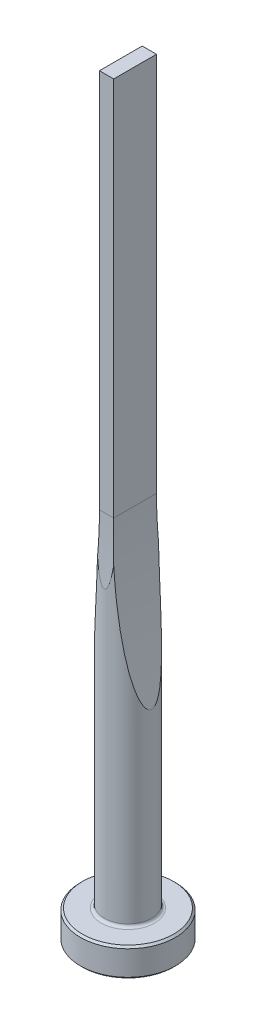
ISO-10303-21;
HEADER;
FILE_DESCRIPTION(('STEP AP214'),'2;1');
FILE_NAME('part.step','',(''),(''),'','','');
FILE_SCHEMA(('AUTOMOTIVE_DESIGN { 1 0 10303 214 1 1 1 1 }'));
ENDSEC;
DATA;
#1=APPLICATION_CONTEXT('core data for automotive mechanical design processes');
#2=APPLICATION_PROTOCOL_DEFINITION('international standard','automotive_design',2000,#1);
#3=PRODUCT_CONTEXT('',#1,'mechanical');
#4=PRODUCT('Part','Part','',(#3));
#5=PRODUCT_RELATED_PRODUCT_CATEGORY('part','',(#4));
#6=PRODUCT_DEFINITION_FORMATION('','',#4);
#7=PRODUCT_DEFINITION_CONTEXT('part definition',#1,'design');
#8=PRODUCT_DEFINITION('design','',#6,#7);
#9=PRODUCT_DEFINITION_SHAPE('','',#8);
#10=(LENGTH_UNIT() NAMED_UNIT(*) SI_UNIT(.MILLI.,.METRE.));
#11=(NAMED_UNIT(*) PLANE_ANGLE_UNIT() SI_UNIT($,.RADIAN.));
#12=(NAMED_UNIT(*) SI_UNIT($,.STERADIAN.) SOLID_ANGLE_UNIT());
#13=UNCERTAINTY_MEASURE_WITH_UNIT(LENGTH_MEASURE(1.E-05),#10,'distance_accuracy_value','');
#14=(GEOMETRIC_REPRESENTATION_CONTEXT(3) GLOBAL_UNCERTAINTY_ASSIGNED_CONTEXT((#13)) GLOBAL_UNIT_ASSIGNED_CONTEXT((#10,
#11,#12)) REPRESENTATION_CONTEXT('',''));
#15=CARTESIAN_POINT('',(0.,0.,0.));
#16=DIRECTION('',(0.,0.,1.));
#17=DIRECTION('',(1.,0.,0.));
#18=AXIS2_PLACEMENT_3D('',#15,#16,#17);
#19=CARTESIAN_POINT('',(0.,0.,0.));
#20=DIRECTION('',(0.,1.,0.));
#21=DIRECTION('',(-1.,0.,0.));
#22=AXIS2_PLACEMENT_3D('',#19,#20,#21);
#23=PLANE('',#22);
#24=CARTESIAN_POINT('',(0.,0.,0.));
#25=DIRECTION('',(0.,1.,0.));
#26=DIRECTION('',(-1.,0.,0.));
#27=AXIS2_PLACEMENT_3D('',#24,#25,#26);
#28=CIRCLE('',#27,4.8);
#29=CARTESIAN_POINT('',(-4.8,0.,0.));
#30=VERTEX_POINT('',#29);
#31=EDGE_CURVE('E133',#30,#30,#28,.T.);
#32=ORIENTED_EDGE('',*,*,#31,.F.);
#33=EDGE_LOOP('',(#32));
#34=FACE_BOUND('',#33,.T.);
#35=ADVANCED_FACE('F32',(#34),#23,.F.);
#36=CARTESIAN_POINT('',(0.,0.,0.));
#37=DIRECTION('',(0.,1.,0.));
#38=DIRECTION('',(-1.,0.,0.));
#39=AXIS2_PLACEMENT_3D('',#36,#37,#38);
#40=CONICAL_SURFACE('',#39,4.8,0.785398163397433);
#41=CARTESIAN_POINT('',(0.,0.200000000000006,0.));
#42=DIRECTION('',(0.,1.,0.));
#43=DIRECTION('',(-1.,0.,0.));
#44=AXIS2_PLACEMENT_3D('',#41,#42,#43);
#45=CIRCLE('',#44,5.);
#46=CARTESIAN_POINT('',(-5.,0.200000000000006,0.));
#47=VERTEX_POINT('',#46);
#48=EDGE_CURVE('E130',#47,#47,#45,.T.);
#49=ORIENTED_EDGE('',*,*,#48,.F.);
#50=EDGE_LOOP('',(#49));
#51=FACE_BOUND('',#50,.T.);
#52=ORIENTED_EDGE('',*,*,#31,.T.);
#53=EDGE_LOOP('',(#52));
#54=FACE_BOUND('',#53,.T.);
#55=ADVANCED_FACE('F171',(#51,#54),#40,.T.);
#56=CARTESIAN_POINT('',(0.,80.,0.));
#57=DIRECTION('',(0.,1.,0.));
#58=DIRECTION('',(-1.,0.,0.));
#59=AXIS2_PLACEMENT_3D('',#56,#57,#58);
#60=CYLINDRICAL_SURFACE('',#59,5.);
#61=CARTESIAN_POINT('',(0.,2.8,0.));
#62=DIRECTION('',(0.,1.,0.));
#63=DIRECTION('',(-1.,0.,0.));
#64=AXIS2_PLACEMENT_3D('',#61,#62,#63);
#65=CIRCLE('',#64,5.);
#66=CARTESIAN_POINT('',(-5.,2.8,0.));
#67=VERTEX_POINT('',#66);
#68=EDGE_CURVE('E127',#67,#67,#65,.T.);
#69=ORIENTED_EDGE('',*,*,#68,.F.);
#70=EDGE_LOOP('',(#69));
#71=FACE_BOUND('',#70,.T.);
#72=ORIENTED_EDGE('',*,*,#48,.T.);
#73=EDGE_LOOP('',(#72));
#74=FACE_BOUND('',#73,.T.);
#75=ADVANCED_FACE('F176',(#71,#74),#60,.T.);
#76=CARTESIAN_POINT('',(0.,2.8,0.));
#77=DIRECTION('',(0.,-1.,0.));
#78=DIRECTION('',(1.,0.,0.));
#79=AXIS2_PLACEMENT_3D('',#76,#77,#78);
#80=CONICAL_SURFACE('',#79,5.,0.785398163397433);
#81=CARTESIAN_POINT('',(0.,3.,0.));
#82=DIRECTION('',(0.,1.,0.));
#83=DIRECTION('',(-1.,0.,0.));
#84=AXIS2_PLACEMENT_3D('',#81,#82,#83);
#85=CIRCLE('',#84,4.8);
#86=CARTESIAN_POINT('',(-4.8,3.,0.));
#87=VERTEX_POINT('',#86);
#88=EDGE_CURVE('E124',#87,#87,#85,.T.);
#89=ORIENTED_EDGE('',*,*,#88,.F.);
#90=EDGE_LOOP('',(#89));
#91=FACE_BOUND('',#90,.T.);
#92=ORIENTED_EDGE('',*,*,#68,.T.);
#93=EDGE_LOOP('',(#92));
#94=FACE_BOUND('',#93,.T.);
#95=ADVANCED_FACE('F183',(#91,#94),#80,.T.);
#96=CARTESIAN_POINT('',(4.8,3.,0.));
#97=DIRECTION('',(0.,-1.,0.));
#98=DIRECTION('',(1.,0.,0.));
#99=AXIS2_PLACEMENT_3D('',#96,#97,#98);
#100=PLANE('',#99);
#101=CARTESIAN_POINT('',(0.,3.,0.));
#102=DIRECTION('',(0.,1.,0.));
#103=DIRECTION('',(-1.,0.,0.));
#104=AXIS2_PLACEMENT_3D('',#101,#102,#103);
#105=CIRCLE('',#104,2.80000000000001);
#106=CARTESIAN_POINT('',(-2.80000000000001,3.,0.));
#107=VERTEX_POINT('',#106);
#108=EDGE_CURVE('E121',#107,#107,#105,.T.);
#109=ORIENTED_EDGE('',*,*,#108,.F.);
#110=EDGE_LOOP('',(#109));
#111=FACE_BOUND('',#110,.T.);
#112=ORIENTED_EDGE('',*,*,#88,.T.);
#113=EDGE_LOOP('',(#112));
#114=FACE_BOUND('',#113,.T.);
#115=ADVANCED_FACE('F190',(#111,#114),#100,.F.);
#116=CARTESIAN_POINT('',(0.,3.3,0.));
#117=DIRECTION('',(0.,1.,0.));
#118=DIRECTION('',(-1.,0.,0.));
#119=AXIS2_PLACEMENT_3D('',#116,#117,#118);
#120=TOROIDAL_SURFACE('',#119,2.80000000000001,0.299999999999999);
#121=CARTESIAN_POINT('',(0.,3.3,0.));
#122=DIRECTION('',(0.,1.,0.));
#123=DIRECTION('',(-1.,0.,0.));
#124=AXIS2_PLACEMENT_3D('',#121,#122,#123);
#125=CIRCLE('',#124,2.50000000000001);
#126=CARTESIAN_POINT('',(-2.50000000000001,3.3,0.));
#127=VERTEX_POINT('',#126);
#128=EDGE_CURVE('E112',#127,#127,#125,.T.);
#129=ORIENTED_EDGE('',*,*,#128,.F.);
#130=EDGE_LOOP('',(#129));
#131=FACE_BOUND('',#130,.T.);
#132=ORIENTED_EDGE('',*,*,#108,.T.);
#133=EDGE_LOOP('',(#132));
#134=FACE_BOUND('',#133,.T.);
#135=ADVANCED_FACE('F168',(#131,#134),#120,.F.);
#136=CARTESIAN_POINT('',(0.,80.,0.));
#137=DIRECTION('',(0.,1.,0.));
#138=DIRECTION('',(-1.,0.,0.));
#139=AXIS2_PLACEMENT_3D('',#136,#137,#138);
#140=CYLINDRICAL_SURFACE('',#139,2.50000000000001);
#141=CARTESIAN_POINT('',(2.50000000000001,22.3382475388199,0.));
#142=CARTESIAN_POINT('',(2.49999974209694,22.3382488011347,0.0299639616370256));
#143=CARTESIAN_POINT('',(2.49945492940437,22.3409704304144,0.0599326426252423));
#144=CARTESIAN_POINT('',(2.49734508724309,22.351517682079,0.118923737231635));
#145=CARTESIAN_POINT('',(2.49577876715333,22.3593497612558,0.14794490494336));
#146=CARTESIAN_POINT('',(2.49121080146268,22.3822164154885,0.212615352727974));
#147=CARTESIAN_POINT('',(2.48792379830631,22.3986852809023,0.247729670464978));
#148=CARTESIAN_POINT('',(2.48032463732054,22.4368342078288,0.314860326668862));
#149=CARTESIAN_POINT('',(2.47601015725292,22.4585260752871,0.346869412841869));
#150=CARTESIAN_POINT('',(2.46314736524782,22.5233470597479,0.43113299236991));
#151=CARTESIAN_POINT('',(2.45387010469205,22.5702555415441,0.480325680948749));
#152=CARTESIAN_POINT('',(2.43420180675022,22.6701866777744,0.571697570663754));
#153=CARTESIAN_POINT('',(2.42380739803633,22.7232278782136,0.61385450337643));
#154=CARTESIAN_POINT('',(2.39667456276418,22.8624034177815,0.714096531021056));
#155=CARTESIAN_POINT('',(2.37952586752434,22.9510180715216,0.768584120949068));
#156=CARTESIAN_POINT('',(2.34463996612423,23.1328433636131,0.869175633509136));
#157=CARTESIAN_POINT('',(2.32690146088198,23.2260644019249,0.915259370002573));
#158=CARTESIAN_POINT('',(2.29112604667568,23.4157610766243,1.00146229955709));
#159=CARTESIAN_POINT('',(2.2730880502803,23.5122514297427,1.04154834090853));
#160=CARTESIAN_POINT('',(2.23702945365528,23.7069387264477,1.11688630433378));
#161=CARTESIAN_POINT('',(2.21900885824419,23.8051335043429,1.15214391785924));
#162=CARTESIAN_POINT('',(2.18226420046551,24.0072767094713,1.22036495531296));
#163=CARTESIAN_POINT('',(2.16354509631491,24.1112847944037,1.25315301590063));
#164=CARTESIAN_POINT('',(2.12630255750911,24.320346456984,1.31534987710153));
#165=CARTESIAN_POINT('',(2.10777914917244,24.425400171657,1.34475822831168));
#166=CARTESIAN_POINT('',(2.05256679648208,24.7418487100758,1.42880939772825));
#167=CARTESIAN_POINT('',(2.01625464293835,24.9544269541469,1.47924468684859));
#168=CARTESIAN_POINT('',(1.94480336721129,25.3820587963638,1.57198773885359));
#169=CARTESIAN_POINT('',(1.90966736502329,25.5971172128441,1.61427511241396));
#170=CARTESIAN_POINT('',(1.84079713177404,26.0285523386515,1.69238726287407));
#171=CARTESIAN_POINT('',(1.8070625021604,26.2449286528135,1.72821388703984));
#172=CARTESIAN_POINT('',(1.74100855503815,26.6790490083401,1.79473825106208));
#173=CARTESIAN_POINT('',(1.70869167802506,26.8967947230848,1.82542738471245));
#174=CARTESIAN_POINT('',(1.64558005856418,27.3330771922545,1.88251828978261));
#175=CARTESIAN_POINT('',(1.61478541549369,27.551613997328,1.90891978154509));
#176=CARTESIAN_POINT('',(1.55479846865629,27.9889770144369,1.95808655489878));
#177=CARTESIAN_POINT('',(1.52560384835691,28.2078023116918,1.98085718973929));
#178=CARTESIAN_POINT('',(1.4687910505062,28.6459464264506,2.02334050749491));
#179=CARTESIAN_POINT('',(1.44117284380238,28.8652652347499,2.04305324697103));
#180=CARTESIAN_POINT('',(1.36084292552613,29.5227284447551,2.09817602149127));
#181=CARTESIAN_POINT('',(1.3105032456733,29.9614924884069,2.12969084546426));
#182=CARTESIAN_POINT('',(1.21624303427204,30.8402145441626,2.18488367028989));
#183=CARTESIAN_POINT('',(1.1723229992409,31.2801726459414,2.20856106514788));
#184=CARTESIAN_POINT('',(1.09093979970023,32.1610823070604,2.24987380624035));
#185=CARTESIAN_POINT('',(1.0534783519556,32.6020340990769,2.26750754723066));
#186=CARTESIAN_POINT('',(0.985053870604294,33.4846060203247,2.2980577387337));
#187=CARTESIAN_POINT('',(0.954090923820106,33.926226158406,2.31097412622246));
#188=CARTESIAN_POINT('',(0.898630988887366,34.8107601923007,2.33309967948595));
#189=CARTESIAN_POINT('',(0.874145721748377,35.2536749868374,2.34230214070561));
#190=CARTESIAN_POINT('',(0.83172489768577,36.1398716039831,2.35769843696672));
#191=CARTESIAN_POINT('',(0.813789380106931,36.5831534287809,2.36389225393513));
#192=CARTESIAN_POINT('',(0.784477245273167,37.4698869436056,2.3737805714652));
#193=CARTESIAN_POINT('',(0.773099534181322,37.9133385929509,2.37747548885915));
#194=CARTESIAN_POINT('',(0.756901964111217,38.8003809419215,2.38268159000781));
#195=CARTESIAN_POINT('',(0.752082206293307,39.2439716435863,2.38419274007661));
#196=CARTESIAN_POINT('',(0.749003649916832,40.1308026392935,2.38516164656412));
#197=CARTESIAN_POINT('',(0.750739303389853,40.5740429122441,2.38462113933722));
#198=CARTESIAN_POINT('',(0.760758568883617,41.4604353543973,2.38144371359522));
#199=CARTESIAN_POINT('',(0.76904208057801,41.9035875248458,2.37880682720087));
#200=CARTESIAN_POINT('',(0.792156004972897,42.7897658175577,2.37121007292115));
#201=CARTESIAN_POINT('',(0.806987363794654,43.2327919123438,2.36624986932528));
#202=CARTESIAN_POINT('',(0.843192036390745,44.1185365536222,2.35359207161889));
#203=CARTESIAN_POINT('',(0.864565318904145,44.5612551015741,2.34589449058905));
#204=CARTESIAN_POINT('',(0.913809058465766,45.4456067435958,2.32715425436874));
#205=CARTESIAN_POINT('',(0.941669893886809,45.8872404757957,2.31611654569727));
#206=CARTESIAN_POINT('',(1.00389211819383,46.7699234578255,2.28983487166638));
#207=CARTESIAN_POINT('',(1.03825343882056,47.2109727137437,2.2745909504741));
#208=CARTESIAN_POINT('',(1.11344668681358,48.0922077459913,2.23874335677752));
#209=CARTESIAN_POINT('',(1.1542772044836,48.532393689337,2.21814085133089));
#210=CARTESIAN_POINT('',(1.24237727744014,49.4117313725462,2.17003044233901));
#211=CARTESIAN_POINT('',(1.28964643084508,49.8508831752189,2.14252296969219));
#212=CARTESIAN_POINT('',(1.36514966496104,50.5069756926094,2.09457318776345));
#213=CARTESIAN_POINT('',(1.39098157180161,50.7244460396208,2.07754923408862));
#214=CARTESIAN_POINT('',(1.44420470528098,51.1589800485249,2.04091149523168));
#215=CARTESIAN_POINT('',(1.47159593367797,51.3760437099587,2.0212977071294));
#216=CARTESIAN_POINT('',(1.52793970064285,51.8098188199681,1.97905052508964));
#217=CARTESIAN_POINT('',(1.55689322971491,52.0265299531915,1.95641520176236));
#218=CARTESIAN_POINT('',(1.61632244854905,52.4593433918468,1.90761148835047));
#219=CARTESIAN_POINT('',(1.64679810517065,52.6754457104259,1.88144317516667));
#220=CARTESIAN_POINT('',(1.70918811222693,53.1065315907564,1.82495082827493));
#221=CARTESIAN_POINT('',(1.74109999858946,53.3215164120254,1.79463374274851));
#222=CARTESIAN_POINT('',(1.80636001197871,53.7504896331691,1.72893369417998));
#223=CARTESIAN_POINT('',(1.83970806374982,53.9644780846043,1.69355099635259));
#224=CARTESIAN_POINT('',(1.90773443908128,54.3909147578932,1.61653581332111));
#225=CARTESIAN_POINT('',(1.94241150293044,54.6033642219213,1.57490914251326));
#226=CARTESIAN_POINT('',(2.01299593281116,55.0263109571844,1.48364476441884));
#227=CARTESIAN_POINT('',(2.04890293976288,55.2368087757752,1.43400937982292));
#228=CARTESIAN_POINT('',(2.10356476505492,55.5505901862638,1.35133144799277));
#229=CARTESIAN_POINT('',(2.12194676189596,55.65500970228,1.32235225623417));
#230=CARTESIAN_POINT('',(2.15891519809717,55.8628758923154,1.26109909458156));
#231=CARTESIAN_POINT('',(2.17750168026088,55.9663223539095,1.22882442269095));
#232=CARTESIAN_POINT('',(2.21472651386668,56.1714617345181,1.1603870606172));
#233=CARTESIAN_POINT('',(2.23336438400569,56.273159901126,1.12423994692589));
#234=CARTESIAN_POINT('',(2.27063774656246,56.4746146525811,1.04692674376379));
#235=CARTESIAN_POINT('',(2.28927323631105,56.5743720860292,1.00576290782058));
#236=CARTESIAN_POINT('',(2.32118376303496,56.7436461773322,0.929145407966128));
#237=CARTESIAN_POINT('',(2.33451045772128,56.8138685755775,0.895279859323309));
#238=CARTESIAN_POINT('',(2.36098921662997,56.9525150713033,0.822941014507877));
#239=CARTESIAN_POINT('',(2.37413983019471,57.0209264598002,0.784442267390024));
#240=CARTESIAN_POINT('',(2.3952408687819,57.1300442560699,0.716644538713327));
#241=CARTESIAN_POINT('',(2.40334612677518,57.1717931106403,0.689078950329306));
#242=CARTESIAN_POINT('',(2.41922653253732,57.2532946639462,0.631069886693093));
#243=CARTESIAN_POINT('',(2.42700189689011,57.2930486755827,0.600628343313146));
#244=CARTESIAN_POINT('',(2.44198697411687,57.3694080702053,0.536450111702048));
#245=CARTESIAN_POINT('',(2.44920067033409,57.4060358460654,0.502741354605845));
#246=CARTESIAN_POINT('',(2.46282096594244,57.4749890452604,0.431091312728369));
#247=CARTESIAN_POINT('',(2.46922995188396,57.5073272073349,0.393163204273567));
#248=CARTESIAN_POINT('',(2.47874666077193,57.5552331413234,0.326373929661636));
#249=CARTESIAN_POINT('',(2.48222668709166,57.5727188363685,0.29895642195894));
#250=CARTESIAN_POINT('',(2.48843384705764,57.6038686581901,0.241907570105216));
#251=CARTESIAN_POINT('',(2.49116114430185,57.6175336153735,0.212276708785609));
#252=CARTESIAN_POINT('',(2.49564729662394,57.6399933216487,0.15068559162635));
#253=CARTESIAN_POINT('',(2.49739396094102,57.6487267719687,0.11870137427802));
#254=CARTESIAN_POINT('',(2.49963581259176,57.6599336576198,0.0536165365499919));
#255=CARTESIAN_POINT('',(2.50013290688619,57.6624166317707,0.0205176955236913));
#256=CARTESIAN_POINT('',(2.49982342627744,57.6608701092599,-0.0417297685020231));
#257=CARTESIAN_POINT('',(2.49915875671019,57.6575495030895,-0.0708993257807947));
#258=CARTESIAN_POINT('',(2.49687373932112,57.6461253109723,-0.128247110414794));
#259=CARTESIAN_POINT('',(2.49525246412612,57.6380170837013,-0.156424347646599));
#260=CARTESIAN_POINT('',(2.49052227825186,57.6143344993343,-0.220589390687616));
#261=CARTESIAN_POINT('',(2.4870942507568,57.5971552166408,-0.255953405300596));
#262=CARTESIAN_POINT('',(2.47921596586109,57.5575937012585,-0.32349707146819));
#263=CARTESIAN_POINT('',(2.47476326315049,57.5351990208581,-0.355668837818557));
#264=CARTESIAN_POINT('',(2.46140541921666,57.467855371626,-0.441105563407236));
#265=CARTESIAN_POINT('',(2.45174732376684,57.4189932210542,-0.491122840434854));
#266=CARTESIAN_POINT('',(2.4313146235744,57.3150994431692,-0.58391480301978));
#267=CARTESIAN_POINT('',(2.42053657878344,57.2600487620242,-0.626666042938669));
#268=CARTESIAN_POINT('',(2.39220322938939,57.1145507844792,-0.729097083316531));
#269=CARTESIAN_POINT('',(2.37422257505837,57.0214952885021,-0.784909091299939));
#270=CARTESIAN_POINT('',(2.33768776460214,56.8307033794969,-0.887783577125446));
#271=CARTESIAN_POINT('',(2.31913233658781,56.7329562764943,-0.934824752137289));
#272=CARTESIAN_POINT('',(2.28174701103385,56.5341613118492,-1.02270155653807));
#273=CARTESIAN_POINT('',(2.26291618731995,56.4330989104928,-1.06350358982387));
#274=CARTESIAN_POINT('',(2.2253037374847,56.2292603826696,-1.14010298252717));
#275=CARTESIAN_POINT('',(2.20652207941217,56.1264864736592,-1.17590632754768));
#276=CARTESIAN_POINT('',(2.16796672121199,55.9133843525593,-1.24563309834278));
#277=CARTESIAN_POINT('',(2.14820170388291,55.8029751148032,-1.2793119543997));
#278=CARTESIAN_POINT('',(2.10891098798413,55.5810797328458,-1.34308990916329));
#279=CARTESIAN_POINT('',(2.08938532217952,55.4695934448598,-1.37318852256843));
#280=CARTESIAN_POINT('',(2.03123427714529,55.1338097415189,-1.45907642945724));
#281=CARTESIAN_POINT('',(1.99305498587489,54.908298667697,-1.51042296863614));
#282=CARTESIAN_POINT('',(1.91805831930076,54.4547277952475,-1.60457182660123));
#283=CARTESIAN_POINT('',(1.8812445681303,54.2266630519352,-1.6473525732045));
#284=CARTESIAN_POINT('',(1.8092172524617,53.7691961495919,-1.72614584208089));
#285=CARTESIAN_POINT('',(1.77400322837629,53.539794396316,-1.76216031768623));
#286=CARTESIAN_POINT('',(1.7051703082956,53.0794720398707,-1.82884949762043));
#287=CARTESIAN_POINT('',(1.67155501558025,52.8485492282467,-1.85951252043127));
#288=CARTESIAN_POINT('',(1.60604860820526,52.385900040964,-1.91637340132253));
#289=CARTESIAN_POINT('',(1.57415760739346,52.1541736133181,-1.94257096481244));
#290=CARTESIAN_POINT('',(1.51218248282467,51.6904475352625,-1.99119375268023));
#291=CARTESIAN_POINT('',(1.48209570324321,51.4584488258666,-2.01362461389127));
#292=CARTESIAN_POINT('',(1.42370026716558,50.9939516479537,-2.05532485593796));
#293=CARTESIAN_POINT('',(1.39539157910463,50.761453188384,-2.07459429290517));
#294=CARTESIAN_POINT('',(1.31314873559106,50.0632640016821,-2.12837009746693));
#295=CARTESIAN_POINT('',(1.2619060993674,49.5969415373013,-2.15883771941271));
#296=CARTESIAN_POINT('',(1.16667979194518,48.6630871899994,-2.21174240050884));
#297=CARTESIAN_POINT('',(1.12269667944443,48.1955552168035,-2.23417884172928));
#298=CARTESIAN_POINT('',(1.04202589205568,47.2594850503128,-2.27292401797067));
#299=CARTESIAN_POINT('',(1.00534020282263,46.7909466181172,-2.28923108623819));
#300=CARTESIAN_POINT('',(0.939305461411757,45.8532112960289,-2.31710729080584));
#301=CARTESIAN_POINT('',(0.909956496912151,45.3840143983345,-2.32867637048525));
#302=CARTESIAN_POINT('',(0.85855961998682,44.4441951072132,-2.34811213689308));
#303=CARTESIAN_POINT('',(0.836526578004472,43.9735717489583,-2.35597129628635));
#304=CARTESIAN_POINT('',(0.799852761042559,43.0319948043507,-2.36867288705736));
#305=CARTESIAN_POINT('',(0.785212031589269,42.561041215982,-2.37351529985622));
#306=CARTESIAN_POINT('',(0.763330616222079,41.6190301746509,-2.38064242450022));
#307=CARTESIAN_POINT('',(0.756088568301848,41.1479727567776,-2.38292760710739));
#308=CARTESIAN_POINT('',(0.749002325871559,40.2057982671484,-2.38516440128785));
#309=CARTESIAN_POINT('',(0.74915810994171,39.7346811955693,-2.38511601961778));
#310=CARTESIAN_POINT('',(0.756853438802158,38.7942225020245,-2.38268527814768));
#311=CARTESIAN_POINT('',(0.764366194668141,38.3248806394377,-2.38031138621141));
#312=CARTESIAN_POINT('',(0.786733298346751,37.3863892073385,-2.37301275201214));
#313=CARTESIAN_POINT('',(0.801587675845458,36.9172396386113,-2.36808799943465));
#314=CARTESIAN_POINT('',(0.838637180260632,35.9791496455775,-2.35522253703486));
#315=CARTESIAN_POINT('',(0.860834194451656,35.5102093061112,-2.34728105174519));
#316=CARTESIAN_POINT('',(0.912557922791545,34.5728143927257,-2.32766070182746));
#317=CARTESIAN_POINT('',(0.942084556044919,34.1043598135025,-2.31598187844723));
#318=CARTESIAN_POINT('',(1.00838950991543,33.1689855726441,-2.28789158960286));
#319=CARTESIAN_POINT('',(1.0451541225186,32.7020646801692,-2.27148904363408));
#320=CARTESIAN_POINT('',(1.1259422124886,31.7691133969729,-2.23254700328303));
#321=CARTESIAN_POINT('',(1.16996553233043,31.3030829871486,-2.21000764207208));
#322=CARTESIAN_POINT('',(1.26520845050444,30.3723956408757,-2.15690518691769));
#323=CARTESIAN_POINT('',(1.31642496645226,29.9077382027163,-2.12634552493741));
#324=CARTESIAN_POINT('',(1.39859035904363,29.2120375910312,-2.0724391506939));
#325=CARTESIAN_POINT('',(1.42686749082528,28.9803623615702,-2.0531269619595));
#326=CARTESIAN_POINT('',(1.48518578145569,28.5175203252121,-2.01134664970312));
#327=CARTESIAN_POINT('',(1.51522689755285,28.2863535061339,-1.98887860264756));
#328=CARTESIAN_POINT('',(1.56799035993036,27.8923053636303,-1.9473513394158));
#329=CARTESIAN_POINT('',(1.5902772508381,27.7292674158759,-1.92922300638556));
#330=CARTESIAN_POINT('',(1.63571117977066,27.4035494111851,-1.89085534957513));
#331=CARTESIAN_POINT('',(1.65885826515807,27.2408693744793,-1.87061590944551));
#332=CARTESIAN_POINT('',(1.70598789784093,26.9160083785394,-1.82773646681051));
#333=CARTESIAN_POINT('',(1.72997013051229,26.753827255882,-1.80509736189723));
#334=CARTESIAN_POINT('',(1.77875723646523,26.4300047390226,-1.75704135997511));
#335=CARTESIAN_POINT('',(1.80356208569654,26.2683633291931,-1.73162454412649));
#336=CARTESIAN_POINT('',(1.86330894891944,25.8859565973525,-1.6675296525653));
#337=CARTESIAN_POINT('',(1.89860089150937,25.6654812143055,-1.62742787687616));
#338=CARTESIAN_POINT('',(1.97058347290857,25.2262152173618,-1.53949687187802));
#339=CARTESIAN_POINT('',(2.00727444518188,25.0074250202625,-1.49166579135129));
#340=CARTESIAN_POINT('',(2.07032920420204,24.639685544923,-1.40204474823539));
#341=CARTESIAN_POINT('',(2.09638379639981,24.490029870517,-1.36294933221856));
#342=CARTESIAN_POINT('',(2.14892380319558,24.1926582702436,-1.2785205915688));
#343=CARTESIAN_POINT('',(2.17540887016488,24.0449409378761,-1.23319209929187));
#344=CARTESIAN_POINT('',(2.22058837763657,23.7964798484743,-1.14913893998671));
#345=CARTESIAN_POINT('',(2.23922250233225,23.6950098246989,-1.112547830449));
#346=CARTESIAN_POINT('',(2.27650756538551,23.4938914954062,-1.03411981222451));
#347=CARTESIAN_POINT('',(2.2951584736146,23.39424679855,-0.992273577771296));
#348=CARTESIAN_POINT('',(2.333407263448,23.1917475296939,-0.898861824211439));
#349=CARTESIAN_POINT('',(2.35299046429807,23.0890883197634,-0.846849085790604));
#350=CARTESIAN_POINT('',(2.38169709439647,22.9399408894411,-0.760538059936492));
#351=CARTESIAN_POINT('',(2.39114177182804,22.8910973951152,-0.730433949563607));
#352=CARTESIAN_POINT('',(2.40967354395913,22.7956670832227,-0.666767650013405));
#353=CARTESIAN_POINT('',(2.41876094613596,22.7490783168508,-0.633208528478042));
#354=CARTESIAN_POINT('',(2.4346071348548,22.6681584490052,-0.568820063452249));
#355=CARTESIAN_POINT('',(2.44146983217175,22.633231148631,-0.538773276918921));
#356=CARTESIAN_POINT('',(2.45464081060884,22.5663914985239,-0.475179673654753));
#357=CARTESIAN_POINT('',(2.46094786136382,22.5344858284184,-0.441625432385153));
#358=CARTESIAN_POINT('',(2.47276187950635,22.474870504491,-0.369860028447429));
#359=CARTESIAN_POINT('',(2.47825506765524,22.4472328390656,-0.331585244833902));
#360=CARTESIAN_POINT('',(2.48775516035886,22.3995247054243,-0.25043079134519));
#361=CARTESIAN_POINT('',(2.49176985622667,22.3794145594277,-0.207576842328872));
#362=CARTESIAN_POINT('',(2.49640282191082,22.356228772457,-0.136623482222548));
#363=CARTESIAN_POINT('',(2.49773907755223,22.3495478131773,-0.109751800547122));
#364=CARTESIAN_POINT('',(2.49953747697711,22.3405581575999,-0.0552543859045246));
#365=CARTESIAN_POINT('',(2.50000023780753,22.3382463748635,-0.0276291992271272));
#366=CARTESIAN_POINT('',(2.50000000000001,22.3382475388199,0.));
#367=B_SPLINE_CURVE_WITH_KNOTS('',3,(#141,#142,#143,#144,#145,#146,#147,#148,#149,#150,#151,
#152,#153,#154,#155,#156,#157,#158,#159,#160,#161,#162,#163,#164,#165,#166,#167,#168,#169,#170,
#171,#172,#173,#174,#175,#176,#177,#178,#179,#180,#181,#182,#183,#184,#185,#186,#187,#188,#189,
#190,#191,#192,#193,#194,#195,#196,#197,#198,#199,#200,#201,#202,#203,#204,#205,#206,#207,#208,
#209,#210,#211,#212,#213,#214,#215,#216,#217,#218,#219,#220,#221,#222,#223,#224,#225,#226,#227,
#228,#229,#230,#231,#232,#233,#234,#235,#236,#237,#238,#239,#240,#241,#242,#243,#244,#245,#246,
#247,#248,#249,#250,#251,#252,#253,#254,#255,#256,#257,#258,#259,#260,#261,#262,#263,#264,#265,
#266,#267,#268,#269,#270,#271,#272,#273,#274,#275,#276,#277,#278,#279,#280,#281,#282,#283,#284,
#285,#286,#287,#288,#289,#290,#291,#292,#293,#294,#295,#296,#297,#298,#299,#300,#301,#302,#303,
#304,#305,#306,#307,#308,#309,#310,#311,#312,#313,#314,#315,#316,#317,#318,#319,#320,#321,#322,
#323,#324,#325,#326,#327,#328,#329,#330,#331,#332,#333,#334,#335,#336,#337,#338,#339,#340,#341,
#342,#343,#344,#345,#346,#347,#348,#349,#350,#351,#352,#353,#354,#355,#356,#357,#358,#359,#360,
#361,#362,#363,#364,#365,#366),.UNSPECIFIED.,.T.,.F.,(4,2,2,2,2,2,2,2,2,2,2,2,2,2,2,2,2,2,2,2,2,
2,2,2,2,2,2,2,2,2,2,2,2,2,2,2,2,2,2,2,2,2,2,2,2,2,2,2,2,2,2,2,2,2,2,2,2,2,2,2,2,2,2,2,2,2,2,2,2,
2,2,2,2,2,2,2,2,2,2,2,2,2,2,2,2,2,2,2,2,2,2,2,2,2,2,2,2,2,2,2,2,2,2,2,2,2,2,2,2,2,2,2,4),(0.,
0.0897803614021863,0.179674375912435,0.295781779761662,0.412154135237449,0.616804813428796,
0.822091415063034,1.13757616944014,1.45380901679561,1.77172990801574,2.08927276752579,
2.42114730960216,2.75306593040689,3.4172354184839,4.08304593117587,4.74866577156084,
5.41538972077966,6.08215713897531,6.74793221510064,7.41369497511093,8.74183269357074,
10.0700730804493,11.3986659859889,12.7272766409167,14.058275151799,15.3892816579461,
16.7200660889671,18.0508710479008,19.3805499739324,20.7102085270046,22.0400592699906,
23.3699036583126,24.6977881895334,26.025658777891,27.353240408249,28.6807392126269,
29.3397018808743,29.9986652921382,30.6580515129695,31.3174233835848,31.9757041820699,
32.6339505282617,33.2915876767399,33.9490344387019,34.2787363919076,34.608508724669,
34.9370011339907,35.2653465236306,35.5025221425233,35.7410657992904,35.8930185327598,
36.0448699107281,36.1955216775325,36.3457155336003,36.4435924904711,36.5414481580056,
36.6404948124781,36.7393902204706,36.8270325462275,36.9147599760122,37.0324847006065,
37.1504933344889,37.3610616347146,37.5722969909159,37.901420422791,38.2313331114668,
38.562964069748,38.8941944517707,39.2454528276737,39.5967587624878,40.2997248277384,
41.0044395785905,41.7089505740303,42.4149806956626,43.1210573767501,43.826067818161,
44.531065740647,45.9412503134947,47.3515433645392,48.7622196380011,50.1729127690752,
51.5864559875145,53.0000079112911,54.4132995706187,55.826587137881,57.2347475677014,
58.6429136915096,60.0514420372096,61.4599548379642,62.8658252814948,64.2716652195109,
65.6769045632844,66.3794590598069,67.0819965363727,67.5786321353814,68.0752951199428,
68.5717729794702,69.0682363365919,69.7486949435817,70.4293167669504,70.8997916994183,
71.3699039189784,71.6981832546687,72.0270536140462,72.3767163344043,72.5510571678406,
72.7252445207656,72.8648209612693,73.0046990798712,73.1467259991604,73.2879933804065,
73.3708366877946,73.4536214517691),.UNSPECIFIED.);
#368=CARTESIAN_POINT('',(0.850781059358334,35.7420152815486,-2.35078105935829));
#369=VERTEX_POINT('',#368);
#370=CARTESIAN_POINT('',(0.850781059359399,35.7420152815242,2.35078105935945));
#371=VERTEX_POINT('',#370);
#372=EDGE_CURVE('E138',#369,#371,#367,.T.);
#373=ORIENTED_EDGE('',*,*,#372,.T.);
#374=CARTESIAN_POINT('',(-1.08972473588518,40.,2.25));
#375=CARTESIAN_POINT('',(-1.08973017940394,40.417843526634,2.25000007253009));
#376=CARTESIAN_POINT('',(-1.08376950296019,40.8356940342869,2.25291055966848));
#377=CARTESIAN_POINT('',(-1.05925903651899,41.6712267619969,2.26454765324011));
#378=CARTESIAN_POINT('',(-1.0407015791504,42.0889087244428,2.2732778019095));
#379=CARTESIAN_POINT('',(-1.00139602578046,42.7150755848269,2.29071964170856));
#380=CARTESIAN_POINT('',(-0.986358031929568,42.9239852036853,2.29726834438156));
#381=CARTESIAN_POINT('',(-0.951794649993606,43.3413786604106,2.31180577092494));
#382=CARTESIAN_POINT('',(-0.932269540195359,43.5498625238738,2.31979440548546));
#383=CARTESIAN_POINT('',(-0.887770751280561,43.9659737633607,2.33718458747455));
#384=CARTESIAN_POINT('',(-0.862802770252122,44.17360180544,2.34658465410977));
#385=CARTESIAN_POINT('',(-0.805815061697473,44.5878049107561,2.3667702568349));
#386=CARTESIAN_POINT('',(-0.773797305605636,44.7943802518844,2.37755540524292));
#387=CARTESIAN_POINT('',(-0.718068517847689,45.1031004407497,2.39473279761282));
#388=CARTESIAN_POINT('',(-0.698175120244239,45.2059606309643,2.40063421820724));
#389=CARTESIAN_POINT('',(-0.655081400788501,45.4110633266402,2.41275302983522));
#390=CARTESIAN_POINT('',(-0.63187863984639,45.5133053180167,2.41897065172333));
#391=CARTESIAN_POINT('',(-0.581182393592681,45.7160803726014,2.43164611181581));
#392=CARTESIAN_POINT('',(-0.553714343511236,45.8166198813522,2.43810236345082));
#393=CARTESIAN_POINT('',(-0.49248365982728,46.0157234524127,2.45121963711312));
#394=CARTESIAN_POINT('',(-0.458730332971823,46.1142901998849,2.45788034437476));
#395=CARTESIAN_POINT('',(-0.406261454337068,46.2433039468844,2.46680425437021));
#396=CARTESIAN_POINT('',(-0.392361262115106,46.2756958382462,2.46906284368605));
#397=CARTESIAN_POINT('',(-0.362888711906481,46.3398145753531,2.47356778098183));
#398=CARTESIAN_POINT('',(-0.347312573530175,46.3715397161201,2.47581408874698));
#399=CARTESIAN_POINT('',(-0.312495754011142,46.4366837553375,2.48046026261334));
#400=CARTESIAN_POINT('',(-0.293050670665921,46.4699944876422,2.48285552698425));
#401=CARTESIAN_POINT('',(-0.250541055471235,46.5342134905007,2.48750743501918));
#402=CARTESIAN_POINT('',(-0.227491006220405,46.5651306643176,2.48976458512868));
#403=CARTESIAN_POINT('',(-0.1910767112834,46.6052165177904,2.49270917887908));
#404=CARTESIAN_POINT('',(-0.18002462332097,46.6164519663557,2.49353684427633));
#405=CARTESIAN_POINT('',(-0.156763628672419,46.6377261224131,2.49510762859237));
#406=CARTESIAN_POINT('',(-0.144552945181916,46.6477629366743,2.49585061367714));
#407=CARTESIAN_POINT('',(-0.118634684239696,46.6661965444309,2.49721781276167));
#408=CARTESIAN_POINT('',(-0.104907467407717,46.6745665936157,2.49784008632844));
#409=CARTESIAN_POINT('',(-0.0761165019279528,46.6885607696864,2.49888187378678));
#410=CARTESIAN_POINT('',(-0.0610589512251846,46.6941969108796,2.49930227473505));
#411=CARTESIAN_POINT('',(-0.0351108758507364,46.7005354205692,2.49977531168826));
#412=CARTESIAN_POINT('',(-0.0244691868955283,46.7022487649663,2.49990327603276));
#413=CARTESIAN_POINT('',(-0.00304761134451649,46.7038251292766,2.50002100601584));
#414=CARTESIAN_POINT('',(0.00773220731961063,46.7036890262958,2.50001083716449));
#415=CARTESIAN_POINT('',(0.0290836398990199,46.7015838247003,2.49985362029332));
#416=CARTESIAN_POINT('',(0.0396556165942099,46.6996182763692,2.49970683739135));
#417=CARTESIAN_POINT('',(0.0603614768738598,46.6940683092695,2.49929272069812));
#418=CARTESIAN_POINT('',(0.0704949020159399,46.6904822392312,2.49902526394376));
#419=CARTESIAN_POINT('',(0.095203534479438,46.6798195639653,2.49823093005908));
#420=CARTESIAN_POINT('',(0.109407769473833,46.6718955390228,2.49764131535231));
#421=CARTESIAN_POINT('',(0.136432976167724,46.653979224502,2.49631126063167));
#422=CARTESIAN_POINT('',(0.149249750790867,46.6439809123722,2.4955703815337));
#423=CARTESIAN_POINT('',(0.184823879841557,46.6128486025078,2.49326963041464));
#424=CARTESIAN_POINT('',(0.205953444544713,46.5898925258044,2.49158038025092));
#425=CARTESIAN_POINT('',(0.245040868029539,46.5414729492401,2.48803849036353));
#426=CARTESIAN_POINT('',(0.262988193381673,46.5160015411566,2.48618533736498));
#427=CARTESIAN_POINT('',(0.309251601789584,46.4439736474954,2.48097806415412));
#428=CARTESIAN_POINT('',(0.335237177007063,46.395943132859,2.47754152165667));
#429=CARTESIAN_POINT('',(0.382999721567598,46.2978052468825,2.47060314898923));
#430=CARTESIAN_POINT('',(0.404765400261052,46.2476927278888,2.46710117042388));
#431=CARTESIAN_POINT('',(0.445440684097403,46.146016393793,2.4600835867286));
#432=CARTESIAN_POINT('',(0.464334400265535,46.094446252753,2.45656800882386));
#433=CARTESIAN_POINT('',(0.499871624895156,45.9906273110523,2.44958188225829));
#434=CARTESIAN_POINT('',(0.516518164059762,45.9383795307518,2.44611127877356));
#435=CARTESIAN_POINT('',(0.570055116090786,45.7604659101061,2.43445124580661));
#436=CARTESIAN_POINT('',(0.602958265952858,45.6335961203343,2.42640128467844));
#437=CARTESIAN_POINT('',(0.662697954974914,45.3783895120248,2.41075844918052));
#438=CARTESIAN_POINT('',(0.689530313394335,45.2500517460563,2.40316589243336));
#439=CARTESIAN_POINT('',(0.73883123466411,44.9922233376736,2.38847091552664));
#440=CARTESIAN_POINT('',(0.761290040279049,44.8627307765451,2.38136961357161));
#441=CARTESIAN_POINT('',(0.802785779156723,44.6031659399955,2.36770048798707));
#442=CARTESIAN_POINT('',(0.821822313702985,44.4730935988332,2.36113272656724));
#443=CARTESIAN_POINT('',(0.87478951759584,44.0823835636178,2.34225784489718));
#444=CARTESIAN_POINT('',(0.904596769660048,43.821146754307,2.33077307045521));
#445=CARTESIAN_POINT('',(0.956195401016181,43.2981762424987,2.31007303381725));
#446=CARTESIAN_POINT('',(0.977997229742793,43.0364436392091,2.30085481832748));
#447=CARTESIAN_POINT('',(1.01364418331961,42.5340508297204,2.28536011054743));
#448=CARTESIAN_POINT('',(1.02799698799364,42.2934317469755,2.27890378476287));
#449=CARTESIAN_POINT('',(1.05200468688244,41.8119106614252,2.26791851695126));
#450=CARTESIAN_POINT('',(1.06165936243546,41.5710086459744,2.26338966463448));
#451=CARTESIAN_POINT('',(1.08427569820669,40.8477062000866,2.25269986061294));
#452=CARTESIAN_POINT('',(1.09086681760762,40.3650526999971,2.24944626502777));
#453=CARTESIAN_POINT('',(1.08826743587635,39.4005215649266,2.25070638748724));
#454=CARTESIAN_POINT('',(1.07910067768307,38.9186438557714,2.2552084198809));
#455=CARTESIAN_POINT('',(1.05232994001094,38.1965993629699,2.26774808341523));
#456=CARTESIAN_POINT('',(1.04124239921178,37.9561303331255,2.27288960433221));
#457=CARTESIAN_POINT('',(1.01419155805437,37.4755202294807,2.2850914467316));
#458=CARTESIAN_POINT('',(0.99822851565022,37.2353791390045,2.29215166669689));
#459=CARTESIAN_POINT('',(0.960610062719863,36.7558420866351,2.30816912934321));
#460=CARTESIAN_POINT('',(0.938960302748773,36.5164456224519,2.31712448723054));
#461=CARTESIAN_POINT('',(0.888559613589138,36.0381620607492,2.33692439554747));
#462=CARTESIAN_POINT('',(0.859800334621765,35.7992758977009,2.34777116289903));
#463=CARTESIAN_POINT('',(0.809334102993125,35.4415432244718,2.36543615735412));
#464=CARTESIAN_POINT('',(0.791245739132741,35.3221520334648,2.37157111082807));
#465=CARTESIAN_POINT('',(0.752062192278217,35.0838917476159,2.38428850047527));
#466=CARTESIAN_POINT('',(0.730967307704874,34.9650226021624,2.39087089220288));
#467=CARTESIAN_POINT('',(0.684984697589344,34.7283066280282,2.40444765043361));
#468=CARTESIAN_POINT('',(0.660105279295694,34.6104581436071,2.41144109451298));
#469=CARTESIAN_POINT('',(0.605188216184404,34.3760080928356,2.42581353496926));
#470=CARTESIAN_POINT('',(0.575153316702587,34.2594058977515,2.43319232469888));
#471=CARTESIAN_POINT('',(0.524064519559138,34.0857489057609,2.44451548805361));
#472=CARTESIAN_POINT('',(0.505939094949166,34.0278283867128,2.44834915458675));
#473=CARTESIAN_POINT('',(0.46699485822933,33.9127359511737,2.4560773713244));
#474=CARTESIAN_POINT('',(0.446170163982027,33.8555659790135,2.45997203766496));
#475=CARTESIAN_POINT('',(0.400982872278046,33.7431082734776,2.46773856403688));
#476=CARTESIAN_POINT('',(0.376646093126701,33.6878101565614,2.4716103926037));
#477=CARTESIAN_POINT('',(0.322567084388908,33.5799691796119,2.47925828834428));
#478=CARTESIAN_POINT('',(0.292848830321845,33.5274153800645,2.48303469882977));
#479=CARTESIAN_POINT('',(0.240881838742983,33.4531788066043,2.48842819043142));
#480=CARTESIAN_POINT('',(0.222183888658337,33.42905962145,2.49019123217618));
#481=CARTESIAN_POINT('',(0.181321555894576,33.3840125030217,2.49350050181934));
#482=CARTESIAN_POINT('',(0.15918607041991,33.363060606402,2.49504834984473));
#483=CARTESIAN_POINT('',(0.124664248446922,33.3379562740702,2.49690963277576));
#484=CARTESIAN_POINT('',(0.114221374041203,33.3311807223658,2.49741292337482));
#485=CARTESIAN_POINT('',(0.0924948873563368,33.3190904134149,2.49831208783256));
#486=CARTESIAN_POINT('',(0.0812111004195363,33.3137759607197,2.49870793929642));
#487=CARTESIAN_POINT('',(0.0577522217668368,33.3050206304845,2.49936060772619));
#488=CARTESIAN_POINT('',(0.0455677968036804,33.3016038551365,2.49961563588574));
#489=CARTESIAN_POINT('',(0.0207704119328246,33.2972019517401,2.49994426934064));
#490=CARTESIAN_POINT('',(0.00815830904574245,33.2962122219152,2.50001821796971));
#491=CARTESIAN_POINT('',(-0.0155552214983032,33.2967707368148,2.49997650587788));
#492=CARTESIAN_POINT('',(-0.0266642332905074,33.2980412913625,2.499881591));
#493=CARTESIAN_POINT('',(-0.0485078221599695,33.3024391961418,2.49955329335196));
#494=CARTESIAN_POINT('',(-0.059241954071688,33.305568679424,2.49931975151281));
#495=CARTESIAN_POINT('',(-0.0837875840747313,33.3147484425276,2.49863544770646));
#496=CARTESIAN_POINT('',(-0.0973551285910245,33.3214386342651,2.49813719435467));
#497=CARTESIAN_POINT('',(-0.123276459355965,33.3368383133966,2.49699260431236));
#498=CARTESIAN_POINT('',(-0.13562720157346,33.3455526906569,2.49634590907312));
#499=CARTESIAN_POINT('',(-0.168932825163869,33.3721120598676,2.49437960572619));
#500=CARTESIAN_POINT('',(-0.188583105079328,33.3915600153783,2.49294489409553));
#501=CARTESIAN_POINT('',(-0.225097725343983,33.4328745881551,2.48991253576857));
#502=CARTESIAN_POINT('',(-0.24195277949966,33.4547488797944,2.48831437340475));
#503=CARTESIAN_POINT('',(-0.283874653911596,33.514529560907,2.4839704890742));
#504=CARTESIAN_POINT('',(-0.307190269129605,33.5536442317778,2.48115187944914));
#505=CARTESIAN_POINT('',(-0.350288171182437,33.6337968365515,2.47543182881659));
#506=CARTESIAN_POINT('',(-0.370061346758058,33.674839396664,2.47253019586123));
#507=CARTESIAN_POINT('',(-0.40717486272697,33.7582740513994,2.46669078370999));
#508=CARTESIAN_POINT('',(-0.424501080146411,33.8006723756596,2.46375289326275));
#509=CARTESIAN_POINT('',(-0.457204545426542,33.8861386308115,2.45789268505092));
#510=CARTESIAN_POINT('',(-0.472584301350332,33.9292056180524,2.45497035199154));
#511=CARTESIAN_POINT('',(-0.521348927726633,34.0734883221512,2.44528588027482));
#512=CARTESIAN_POINT('',(-0.551455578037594,34.1758119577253,2.43858951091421));
#513=CARTESIAN_POINT('',(-0.606551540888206,34.3818614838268,2.42546430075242));
#514=CARTESIAN_POINT('',(-0.63153710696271,34.4855883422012,2.41903565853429));
#515=CARTESIAN_POINT('',(-0.67782406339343,34.6941236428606,2.40647709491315));
#516=CARTESIAN_POINT('',(-0.699116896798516,34.7989340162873,2.40034789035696));
#517=CARTESIAN_POINT('',(-0.738809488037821,35.0091243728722,2.38842728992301));
#518=CARTESIAN_POINT('',(-0.757208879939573,35.114504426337,2.38263593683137));
#519=CARTESIAN_POINT('',(-0.808916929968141,35.4311534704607,2.36579508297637));
#520=CARTESIAN_POINT('',(-0.838753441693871,35.6430174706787,2.35527359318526));
#521=CARTESIAN_POINT('',(-0.89175308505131,36.0673268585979,2.33571214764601));
#522=CARTESIAN_POINT('',(-0.914924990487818,36.2797711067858,2.32667025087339));
#523=CARTESIAN_POINT('',(-0.963653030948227,36.7837885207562,2.30701281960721));
#524=CARTESIAN_POINT('',(-0.98692879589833,37.0756070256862,2.29704951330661));
#525=CARTESIAN_POINT('',(-1.02579741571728,37.6599618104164,2.27995094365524));
#526=CARTESIAN_POINT('',(-1.041386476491,37.9524983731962,2.27281707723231));
#527=CARTESIAN_POINT('',(-1.06593128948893,38.5374527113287,2.26140963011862));
#528=CARTESIAN_POINT('',(-1.07489717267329,38.8298699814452,2.25713168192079));
#529=CARTESIAN_POINT('',(-1.08679206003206,39.4148570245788,2.25142680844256));
#530=CARTESIAN_POINT('',(-1.08972092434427,39.7074268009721,2.24999994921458));
#531=CARTESIAN_POINT('',(-1.08972473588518,40.,2.25));
#532=B_SPLINE_CURVE_WITH_KNOTS('',3,(#374,#375,#376,#377,#378,#379,#380,#381,#382,#383,#384,
#385,#386,#387,#388,#389,#390,#391,#392,#393,#394,#395,#396,#397,#398,#399,#400,#401,#402,#403,
#404,#405,#406,#407,#408,#409,#410,#411,#412,#413,#414,#415,#416,#417,#418,#419,#420,#421,#422,
#423,#424,#425,#426,#427,#428,#429,#430,#431,#432,#433,#434,#435,#436,#437,#438,#439,#440,#441,
#442,#443,#444,#445,#446,#447,#448,#449,#450,#451,#452,#453,#454,#455,#456,#457,#458,#459,#460,
#461,#462,#463,#464,#465,#466,#467,#468,#469,#470,#471,#472,#473,#474,#475,#476,#477,#478,#479,
#480,#481,#482,#483,#484,#485,#486,#487,#488,#489,#490,#491,#492,#493,#494,#495,#496,#497,#498,
#499,#500,#501,#502,#503,#504,#505,#506,#507,#508,#509,#510,#511,#512,#513,#514,#515,#516,#517,
#518,#519,#520,#521,#522,#523,#524,#525,#526,#527,#528,#529,#530,#531),.UNSPECIFIED.,.T.,.F.,(4,
2,2,2,2,2,2,2,2,2,2,2,2,2,2,2,2,2,2,2,2,2,2,2,2,2,2,2,2,2,2,2,2,2,2,2,2,2,2,2,2,2,2,2,2,2,2,2,2,
2,2,2,2,2,2,2,2,2,2,2,2,2,2,2,2,2,2,2,2,2,2,2,2,2,2,2,2,2,4),(0.,1.25349579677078,
2.5077552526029,3.13637255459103,3.76495088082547,4.39287428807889,5.02062232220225,
5.33538342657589,5.65037772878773,5.96356106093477,6.27628429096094,6.38221512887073,
6.48839013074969,6.60421617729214,6.71958832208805,6.76687074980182,6.81422689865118,
6.86229060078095,6.91014112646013,6.94233304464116,6.97450969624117,7.0066240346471,
7.03877117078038,7.08731649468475,7.13600479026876,7.22921726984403,7.32273275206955,
7.48645092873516,7.65060127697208,7.81562908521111,7.98043205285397,8.3740796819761,
8.76799758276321,9.16278447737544,9.55761733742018,10.3469594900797,11.1352676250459,
11.8586053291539,12.5819766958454,14.0297514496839,15.4753467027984,16.1976403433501,
16.9198957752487,17.6414362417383,18.3638281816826,18.7265281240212,19.0891920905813,
19.4510711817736,19.8127581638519,19.995152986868,20.1779521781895,20.3594702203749,
20.5401986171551,20.6317429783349,20.7225557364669,20.7598439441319,20.7971399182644,
20.8348993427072,20.8725871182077,20.9059585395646,20.9393683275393,20.9845173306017,
21.0297765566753,21.1123623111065,21.1952171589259,21.3317310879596,21.4685912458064,
21.6062115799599,21.7436527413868,22.0640092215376,22.3845992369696,22.7059224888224,
23.0272863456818,23.6697499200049,24.311363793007,25.1899528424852,26.0689751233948,
26.9466500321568,27.8243452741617),.UNSPECIFIED.);
#533=CARTESIAN_POINT('',(-0.850781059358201,35.7420152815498,2.3507810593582));
#534=VERTEX_POINT('',#533);
#535=EDGE_CURVE('E104',#371,#534,#532,.T.);
#536=ORIENTED_EDGE('',*,*,#535,.T.);
#537=CARTESIAN_POINT('',(-2.50000000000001,22.3382475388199,0.));
#538=CARTESIAN_POINT('',(-2.49999974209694,22.3382488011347,-0.0299639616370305));
#539=CARTESIAN_POINT('',(-2.49945492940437,22.3409704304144,-0.0599326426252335));
#540=CARTESIAN_POINT('',(-2.49734508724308,22.351517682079,-0.118923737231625));
#541=CARTESIAN_POINT('',(-2.49577876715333,22.3593497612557,-0.147944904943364));
#542=CARTESIAN_POINT('',(-2.49121080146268,22.3822164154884,-0.212615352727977));
#543=CARTESIAN_POINT('',(-2.48792379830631,22.3986852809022,-0.247729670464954));
#544=CARTESIAN_POINT('',(-2.48032463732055,22.4368342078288,-0.314860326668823));
#545=CARTESIAN_POINT('',(-2.47601015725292,22.4585260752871,-0.346869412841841));
#546=CARTESIAN_POINT('',(-2.46314736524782,22.5233470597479,-0.431132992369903));
#547=CARTESIAN_POINT('',(-2.45387010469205,22.5702555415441,-0.480325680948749));
#548=CARTESIAN_POINT('',(-2.43420180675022,22.6701866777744,-0.571697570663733));
#549=CARTESIAN_POINT('',(-2.42380739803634,22.7232278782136,-0.613854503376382));
#550=CARTESIAN_POINT('',(-2.39667456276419,22.8624034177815,-0.714096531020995));
#551=CARTESIAN_POINT('',(-2.37952586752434,22.9510180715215,-0.768584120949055));
#552=CARTESIAN_POINT('',(-2.34463996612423,23.132843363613,-0.869175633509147));
#553=CARTESIAN_POINT('',(-2.32690146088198,23.2260644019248,-0.91525937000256));
#554=CARTESIAN_POINT('',(-2.2911260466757,23.4157610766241,-1.00146229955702));
#555=CARTESIAN_POINT('',(-2.27308805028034,23.5122514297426,-1.04154834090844));
#556=CARTESIAN_POINT('',(-2.23702945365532,23.7069387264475,-1.11688630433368));
#557=CARTESIAN_POINT('',(-2.21900885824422,23.8051335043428,-1.15214391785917));
#558=CARTESIAN_POINT('',(-2.18226420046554,24.0072767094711,-1.2203649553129));
#559=CARTESIAN_POINT('',(-2.16354509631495,24.1112847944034,-1.25315301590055));
#560=CARTESIAN_POINT('',(-2.12630255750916,24.3203464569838,-1.31534987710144));
#561=CARTESIAN_POINT('',(-2.10777914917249,24.4254001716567,-1.3447582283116));
#562=CARTESIAN_POINT('',(-2.05256679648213,24.7418487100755,-1.42880939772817));
#563=CARTESIAN_POINT('',(-2.01625464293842,24.9544269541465,-1.4792446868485));
#564=CARTESIAN_POINT('',(-1.94480336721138,25.3820587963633,-1.57198773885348));
#565=CARTESIAN_POINT('',(-1.90966736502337,25.5971172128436,-1.61427511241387));
#566=CARTESIAN_POINT('',(-1.84079713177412,26.0285523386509,-1.69238726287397));
#567=CARTESIAN_POINT('',(-1.80706250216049,26.2449286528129,-1.72821388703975));
#568=CARTESIAN_POINT('',(-1.74100855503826,26.6790490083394,-1.79473825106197));
#569=CARTESIAN_POINT('',(-1.70869167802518,26.896794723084,-1.82542738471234));
#570=CARTESIAN_POINT('',(-1.6455800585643,27.3330771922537,-1.88251828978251));
#571=CARTESIAN_POINT('',(-1.6147854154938,27.5516139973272,-1.90891978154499));
#572=CARTESIAN_POINT('',(-1.55479846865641,27.9889770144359,-1.95808655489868));
#573=CARTESIAN_POINT('',(-1.52560384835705,28.2078023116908,-1.98085718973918));
#574=CARTESIAN_POINT('',(-1.46879105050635,28.6459464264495,-2.02334050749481));
#575=CARTESIAN_POINT('',(-1.44117284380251,28.8652652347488,-2.04305324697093));
#576=CARTESIAN_POINT('',(-1.36084292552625,29.5227284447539,-2.09817602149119));
#577=CARTESIAN_POINT('',(-1.31050324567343,29.9614924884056,-2.12969084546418));
#578=CARTESIAN_POINT('',(-1.21624303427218,30.8402145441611,-2.18488367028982));
#579=CARTESIAN_POINT('',(-1.17232299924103,31.2801726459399,-2.20856106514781));
#580=CARTESIAN_POINT('',(-1.09093979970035,32.1610823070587,-2.24987380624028));
#581=CARTESIAN_POINT('',(-1.05347835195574,32.6020340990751,-2.2675075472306));
#582=CARTESIAN_POINT('',(-0.985053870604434,33.4846060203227,-2.29805773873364));
#583=CARTESIAN_POINT('',(-0.954090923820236,33.926226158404,-2.3109741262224));
#584=CARTESIAN_POINT('',(-0.89863098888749,34.8107601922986,-2.3330996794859));
#585=CARTESIAN_POINT('',(-0.874145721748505,35.2536749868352,-2.34230214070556));
#586=CARTESIAN_POINT('',(-0.831724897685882,36.1398716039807,-2.35769843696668));
#587=CARTESIAN_POINT('',(-0.813789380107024,36.5831534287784,-2.3638922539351));
#588=CARTESIAN_POINT('',(-0.784477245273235,37.469886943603,-2.37378057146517));
#589=CARTESIAN_POINT('',(-0.773099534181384,37.9133385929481,-2.37747548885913));
#590=CARTESIAN_POINT('',(-0.756901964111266,38.8003809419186,-2.38268159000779));
#591=CARTESIAN_POINT('',(-0.75208220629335,39.2439716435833,-2.38419274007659));
#592=CARTESIAN_POINT('',(-0.749003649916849,40.1308026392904,-2.38516164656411));
#593=CARTESIAN_POINT('',(-0.750739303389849,40.5740429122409,-2.38462113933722));
#594=CARTESIAN_POINT('',(-0.76075856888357,41.4604353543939,-2.38144371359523));
#595=CARTESIAN_POINT('',(-0.769042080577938,41.9035875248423,-2.37880682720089));
#596=CARTESIAN_POINT('',(-0.792156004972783,42.7897658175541,-2.37121007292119));
#597=CARTESIAN_POINT('',(-0.806987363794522,43.2327919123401,-2.36624986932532));
#598=CARTESIAN_POINT('',(-0.84319203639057,44.1185365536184,-2.35359207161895));
#599=CARTESIAN_POINT('',(-0.864565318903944,44.5612551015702,-2.34589449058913));
#600=CARTESIAN_POINT('',(-0.913809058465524,45.4456067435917,-2.32715425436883));
#601=CARTESIAN_POINT('',(-0.941669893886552,45.8872404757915,-2.31611654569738));
#602=CARTESIAN_POINT('',(-1.00389211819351,46.7699234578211,-2.28983487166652));
#603=CARTESIAN_POINT('',(-1.03825343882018,47.2109727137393,-2.27459095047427));
#604=CARTESIAN_POINT('',(-1.11344668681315,48.0922077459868,-2.23874335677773));
#605=CARTESIAN_POINT('',(-1.15427720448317,48.5323936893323,-2.21814085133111));
#606=CARTESIAN_POINT('',(-1.24237727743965,49.4117313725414,-2.17003044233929));
#607=CARTESIAN_POINT('',(-1.28964643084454,49.850883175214,-2.14252296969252));
#608=CARTESIAN_POINT('',(-1.36514966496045,50.5069756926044,-2.09457318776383));
#609=CARTESIAN_POINT('',(-1.390981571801,50.7244460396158,-2.07754923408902));
#610=CARTESIAN_POINT('',(-1.44420470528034,51.1589800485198,-2.04091149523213));
#611=CARTESIAN_POINT('',(-1.47159593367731,51.3760437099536,-2.02129770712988));
#612=CARTESIAN_POINT('',(-1.52793970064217,51.8098188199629,-1.97905052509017));
#613=CARTESIAN_POINT('',(-1.55689322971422,52.0265299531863,-1.95641520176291));
#614=CARTESIAN_POINT('',(-1.61632244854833,52.4593433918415,-1.90761148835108));
#615=CARTESIAN_POINT('',(-1.6467981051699,52.6754457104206,-1.88144317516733));
#616=CARTESIAN_POINT('',(-1.70918811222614,53.106531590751,-1.82495082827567));
#617=CARTESIAN_POINT('',(-1.74109999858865,53.32151641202,-1.7946337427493));
#618=CARTESIAN_POINT('',(-1.80636001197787,53.7504896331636,-1.72893369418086));
#619=CARTESIAN_POINT('',(-1.83970806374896,53.9644780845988,-1.69355099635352));
#620=CARTESIAN_POINT('',(-1.90773443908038,54.3909147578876,-1.61653581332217));
#621=CARTESIAN_POINT('',(-1.94241150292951,54.6033642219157,-1.57490914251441));
#622=CARTESIAN_POINT('',(-2.0129959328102,55.0263109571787,-1.48364476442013));
#623=CARTESIAN_POINT('',(-2.04890293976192,55.2368087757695,-1.43400937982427));
#624=CARTESIAN_POINT('',(-2.10356476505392,55.550590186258,-1.35133144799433));
#625=CARTESIAN_POINT('',(-2.12194676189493,55.6550097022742,-1.32235225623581));
#626=CARTESIAN_POINT('',(-2.15891519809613,55.8628758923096,-1.26109909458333));
#627=CARTESIAN_POINT('',(-2.17750168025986,55.9663223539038,-1.22882442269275));
#628=CARTESIAN_POINT('',(-2.21472651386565,56.1714617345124,-1.16038706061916));
#629=CARTESIAN_POINT('',(-2.23336438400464,56.2731599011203,-1.12423994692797));
#630=CARTESIAN_POINT('',(-2.27063774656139,56.4746146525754,-1.04692674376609));
#631=CARTESIAN_POINT('',(-2.28927323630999,56.5743720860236,-1.00576290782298));
#632=CARTESIAN_POINT('',(-2.32118376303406,56.7436461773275,-0.929145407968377));
#633=CARTESIAN_POINT('',(-2.33451045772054,56.8138685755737,-0.895279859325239));
#634=CARTESIAN_POINT('',(-2.36098921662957,56.9525150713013,-0.822941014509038));
#635=CARTESIAN_POINT('',(-2.37413983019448,57.020926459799,-0.784442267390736));
#636=CARTESIAN_POINT('',(-2.39524086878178,57.1300442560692,-0.716644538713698));
#637=CARTESIAN_POINT('',(-2.40334612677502,57.1717931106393,-0.68907895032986));
#638=CARTESIAN_POINT('',(-2.41922653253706,57.2532946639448,-0.631069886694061));
#639=CARTESIAN_POINT('',(-2.42700189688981,57.2930486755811,-0.600628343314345));
#640=CARTESIAN_POINT('',(-2.44198697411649,57.3694080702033,-0.536450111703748));
#641=CARTESIAN_POINT('',(-2.44920067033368,57.4060358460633,-0.502741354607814));
#642=CARTESIAN_POINT('',(-2.46282096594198,57.4749890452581,-0.431091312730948));
#643=CARTESIAN_POINT('',(-2.46922995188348,57.5073272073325,-0.393163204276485));
#644=CARTESIAN_POINT('',(-2.47874666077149,57.5552331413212,-0.326373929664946));
#645=CARTESIAN_POINT('',(-2.48222668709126,57.5727188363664,-0.298956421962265));
#646=CARTESIAN_POINT('',(-2.48843384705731,57.6038686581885,-0.24190757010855));
#647=CARTESIAN_POINT('',(-2.49116114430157,57.617533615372,-0.212276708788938));
#648=CARTESIAN_POINT('',(-2.49564729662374,57.6399933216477,-0.150685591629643));
#649=CARTESIAN_POINT('',(-2.49739396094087,57.648726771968,-0.118701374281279));
#650=CARTESIAN_POINT('',(-2.49963581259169,57.6599336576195,-0.0536165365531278));
#651=CARTESIAN_POINT('',(-2.50013290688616,57.6624166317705,-0.0205176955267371));
#652=CARTESIAN_POINT('',(-2.49982342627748,57.66087010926,0.041729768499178));
#653=CARTESIAN_POINT('',(-2.49915875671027,57.6575495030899,0.0708993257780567));
#654=CARTESIAN_POINT('',(-2.49687373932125,57.6461253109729,0.12824711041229));
#655=CARTESIAN_POINT('',(-2.49525246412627,57.638017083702,0.156424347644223));
#656=CARTESIAN_POINT('',(-2.49052227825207,57.6143344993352,0.220589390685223));
#657=CARTESIAN_POINT('',(-2.48709425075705,57.5971552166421,0.255953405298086));
#658=CARTESIAN_POINT('',(-2.47921596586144,57.5575937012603,0.323497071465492));
#659=CARTESIAN_POINT('',(-2.47476326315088,57.5351990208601,0.355668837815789));
#660=CARTESIAN_POINT('',(-2.46140541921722,57.4678553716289,0.441105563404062));
#661=CARTESIAN_POINT('',(-2.45174732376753,57.4189932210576,0.491122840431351));
#662=CARTESIAN_POINT('',(-2.43131462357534,57.3150994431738,0.583914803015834));
#663=CARTESIAN_POINT('',(-2.42053657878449,57.2600487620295,0.626666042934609));
#664=CARTESIAN_POINT('',(-2.39220322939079,57.1145507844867,0.729097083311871));
#665=CARTESIAN_POINT('',(-2.37422257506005,57.021495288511,0.784909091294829));
#666=CARTESIAN_POINT('',(-2.33768776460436,56.8307033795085,0.887783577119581));
#667=CARTESIAN_POINT('',(-2.31913233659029,56.7329562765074,0.93482475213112));
#668=CARTESIAN_POINT('',(-2.28174701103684,56.5341613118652,1.02270155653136));
#669=CARTESIAN_POINT('',(-2.2629161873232,56.4330989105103,1.06350358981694));
#670=CARTESIAN_POINT('',(-2.22530373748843,56.22926038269,1.14010298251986));
#671=CARTESIAN_POINT('',(-2.20652207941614,56.126486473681,1.17590632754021));
#672=CARTESIAN_POINT('',(-2.16796672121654,55.9133843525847,1.24563309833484));
#673=CARTESIAN_POINT('',(-2.14820170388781,55.8029751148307,1.27931195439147));
#674=CARTESIAN_POINT('',(-2.10891098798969,55.5810797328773,1.34308990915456));
#675=CARTESIAN_POINT('',(-2.08938532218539,55.4695934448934,1.37318852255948));
#676=CARTESIAN_POINT('',(-2.0312342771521,55.1338097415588,1.45907642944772));
#677=CARTESIAN_POINT('',(-1.9930549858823,54.9082986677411,1.51042296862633));
#678=CARTESIAN_POINT('',(-1.91805831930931,54.4547277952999,1.604571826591));
#679=CARTESIAN_POINT('',(-1.88124456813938,54.2266630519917,1.64735257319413));
#680=CARTESIAN_POINT('',(-1.80921725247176,53.7691961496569,1.72614584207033));
#681=CARTESIAN_POINT('',(-1.77400322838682,53.5397943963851,1.76216031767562));
#682=CARTESIAN_POINT('',(-1.70517030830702,53.0794720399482,1.82884949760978));
#683=CARTESIAN_POINT('',(-1.67155501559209,52.8485492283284,1.85951252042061));
#684=CARTESIAN_POINT('',(-1.60604860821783,52.3859000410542,1.91637340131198));
#685=CARTESIAN_POINT('',(-1.57415760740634,52.1541736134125,1.942570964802));
#686=CARTESIAN_POINT('',(-1.51218248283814,51.6904475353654,1.99119375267));
#687=CARTESIAN_POINT('',(-1.48209570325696,51.4584488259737,2.01362461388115));
#688=CARTESIAN_POINT('',(-1.42370026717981,50.9939516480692,2.05532485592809));
#689=CARTESIAN_POINT('',(-1.39539157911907,50.7614531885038,2.07459429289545));
#690=CARTESIAN_POINT('',(-1.31314873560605,50.0632640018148,2.12837009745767));
#691=CARTESIAN_POINT('',(-1.26190609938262,49.5969415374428,2.15883771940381));
#692=CARTESIAN_POINT('',(-1.16667979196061,48.6630871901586,2.2117424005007));
#693=CARTESIAN_POINT('',(-1.12269667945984,48.1955552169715,2.23417884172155));
#694=CARTESIAN_POINT('',(-1.04202589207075,47.2594850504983,2.27292401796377));
#695=CARTESIAN_POINT('',(-1.00534020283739,46.7909466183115,2.28923108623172));
#696=CARTESIAN_POINT('',(-0.93930546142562,45.8532112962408,2.31710729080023));
#697=CARTESIAN_POINT('',(-0.909956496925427,45.3840143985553,2.32867637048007));
#698=CARTESIAN_POINT('',(-0.858559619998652,44.4441951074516,2.34811213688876));
#699=CARTESIAN_POINT('',(-0.836526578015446,43.9735717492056,2.35597129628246));
#700=CARTESIAN_POINT('',(-0.799852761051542,43.0319948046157,2.36867288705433));
#701=CARTESIAN_POINT('',(-0.785212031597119,42.5610412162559,2.37351529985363));
#702=CARTESIAN_POINT('',(-0.763330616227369,41.6190301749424,2.38064242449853));
#703=CARTESIAN_POINT('',(-0.756088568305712,41.1479727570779,2.38292760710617));
#704=CARTESIAN_POINT('',(-0.749002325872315,40.2057982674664,2.38516440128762));
#705=CARTESIAN_POINT('',(-0.749158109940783,39.7346811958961,2.38511601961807));
#706=CARTESIAN_POINT('',(-0.756853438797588,38.7942225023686,2.38268527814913));
#707=CARTESIAN_POINT('',(-0.764366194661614,38.3248806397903,2.38031138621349));
#708=CARTESIAN_POINT('',(-0.786733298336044,37.3863892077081,2.37301275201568));
#709=CARTESIAN_POINT('',(-0.801587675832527,36.9172396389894,2.36808799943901));
#710=CARTESIAN_POINT('',(-0.838637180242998,35.9791496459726,2.35522253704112));
#711=CARTESIAN_POINT('',(-0.860834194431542,35.5102093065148,2.34728105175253));
#712=CARTESIAN_POINT('',(-0.912557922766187,34.5728143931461,2.32766070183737));
#713=CARTESIAN_POINT('',(-0.942084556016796,34.1043598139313,2.31598187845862));
#714=CARTESIAN_POINT('',(-1.00838950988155,33.1689855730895,2.28789158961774));
#715=CARTESIAN_POINT('',(-1.04515412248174,32.7020646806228,2.27148904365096));
#716=CARTESIAN_POINT('',(-1.12594221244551,31.7691133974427,2.23254700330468));
#717=CARTESIAN_POINT('',(-1.16996553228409,31.3030829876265,2.2100076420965));
#718=CARTESIAN_POINT('',(-1.26520845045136,30.3723956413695,2.15690518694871));
#719=CARTESIAN_POINT('',(-1.3164249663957,29.9077382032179,2.12634552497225));
#720=CARTESIAN_POINT('',(-1.39859035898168,29.2120375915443,2.07243915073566));
#721=CARTESIAN_POINT('',(-1.42686749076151,28.9803623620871,2.05312696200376));
#722=CARTESIAN_POINT('',(-1.48518578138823,28.5175203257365,2.01134664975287));
#723=CARTESIAN_POINT('',(-1.51522689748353,28.286353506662,1.9888786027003));
#724=CARTESIAN_POINT('',(-1.56799035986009,27.8923053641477,1.94735133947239));
#725=CARTESIAN_POINT('',(-1.59027725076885,27.7292674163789,1.92922300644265));
#726=CARTESIAN_POINT('',(-1.6357111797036,27.4035494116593,1.89085534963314));
#727=CARTESIAN_POINT('',(-1.65885826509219,27.2408693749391,1.87061590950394));
#728=CARTESIAN_POINT('',(-1.70598789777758,26.9160083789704,1.82773646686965));
#729=CARTESIAN_POINT('',(-1.72997013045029,26.7538272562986,1.80509736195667));
#730=CARTESIAN_POINT('',(-1.77875723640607,26.4300047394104,1.75704136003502));
#731=CARTESIAN_POINT('',(-1.80356208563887,26.2683633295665,1.73162454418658));
#732=CARTESIAN_POINT('',(-1.86330894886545,25.8859565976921,1.66752965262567));
#733=CARTESIAN_POINT('',(-1.89860089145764,25.6654812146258,1.62742787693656));
#734=CARTESIAN_POINT('',(-1.97058347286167,25.2262152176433,1.53949687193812));
#735=CARTESIAN_POINT('',(-2.00727444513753,25.0074250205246,1.49166579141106));
#736=CARTESIAN_POINT('',(-2.07032920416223,24.6396855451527,1.40204474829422));
#737=CARTESIAN_POINT('',(-2.0963837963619,24.4900298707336,1.36294933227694));
#738=CARTESIAN_POINT('',(-2.14892380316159,24.1926582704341,1.27852059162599));
#739=CARTESIAN_POINT('',(-2.17540887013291,24.0449409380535,1.23319209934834));
#740=CARTESIAN_POINT('',(-2.22058837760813,23.7964798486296,1.1491389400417));
#741=CARTESIAN_POINT('',(-2.23922250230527,23.6950098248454,1.11254783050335));
#742=CARTESIAN_POINT('',(-2.2765075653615,23.4938914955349,1.03411981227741));
#743=CARTESIAN_POINT('',(-2.29515847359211,23.3942467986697,0.992273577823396));
#744=CARTESIAN_POINT('',(-2.33340726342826,23.1917475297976,0.898861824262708));
#745=CARTESIAN_POINT('',(-2.35299046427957,23.0890883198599,0.846849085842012));
#746=CARTESIAN_POINT('',(-2.38169709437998,22.9399408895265,0.760538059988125));
#747=CARTESIAN_POINT('',(-2.39114177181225,22.8910973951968,0.73043394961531));
#748=CARTESIAN_POINT('',(-2.40967354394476,22.7956670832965,0.666767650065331));
#749=CARTESIAN_POINT('',(-2.41876094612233,22.7490783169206,0.633208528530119));
#750=CARTESIAN_POINT('',(-2.43460713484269,22.6681584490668,0.568820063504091));
#751=CARTESIAN_POINT('',(-2.44146983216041,22.6332311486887,0.538773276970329));
#752=CARTESIAN_POINT('',(-2.45464081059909,22.5663914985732,0.47517967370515));
#753=CARTESIAN_POINT('',(-2.46094786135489,22.5344858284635,0.441625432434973));
#754=CARTESIAN_POINT('',(-2.47276187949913,22.4748705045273,0.369860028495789));
#755=CARTESIAN_POINT('',(-2.47825506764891,22.4472328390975,0.331585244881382));
#756=CARTESIAN_POINT('',(-2.48775516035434,22.399524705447,0.250430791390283));
#757=CARTESIAN_POINT('',(-2.49176985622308,22.3794145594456,0.207576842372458));
#758=CARTESIAN_POINT('',(-2.49640282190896,22.3562287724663,0.136623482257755));
#759=CARTESIAN_POINT('',(-2.49773907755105,22.3495478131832,0.109751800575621));
#760=CARTESIAN_POINT('',(-2.49953747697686,22.3405581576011,0.0552543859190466));
#761=CARTESIAN_POINT('',(-2.50000023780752,22.3382463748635,0.0276291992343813));
#762=CARTESIAN_POINT('',(-2.50000000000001,22.3382475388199,0.));
#763=B_SPLINE_CURVE_WITH_KNOTS('',3,(#537,#538,#539,#540,#541,#542,#543,#544,#545,#546,#547,
#548,#549,#550,#551,#552,#553,#554,#555,#556,#557,#558,#559,#560,#561,#562,#563,#564,#565,#566,
#567,#568,#569,#570,#571,#572,#573,#574,#575,#576,#577,#578,#579,#580,#581,#582,#583,#584,#585,
#586,#587,#588,#589,#590,#591,#592,#593,#594,#595,#596,#597,#598,#599,#600,#601,#602,#603,#604,
#605,#606,#607,#608,#609,#610,#611,#612,#613,#614,#615,#616,#617,#618,#619,#620,#621,#622,#623,
#624,#625,#626,#627,#628,#629,#630,#631,#632,#633,#634,#635,#636,#637,#638,#639,#640,#641,#642,
#643,#644,#645,#646,#647,#648,#649,#650,#651,#652,#653,#654,#655,#656,#657,#658,#659,#660,#661,
#662,#663,#664,#665,#666,#667,#668,#669,#670,#671,#672,#673,#674,#675,#676,#677,#678,#679,#680,
#681,#682,#683,#684,#685,#686,#687,#688,#689,#690,#691,#692,#693,#694,#695,#696,#697,#698,#699,
#700,#701,#702,#703,#704,#705,#706,#707,#708,#709,#710,#711,#712,#713,#714,#715,#716,#717,#718,
#719,#720,#721,#722,#723,#724,#725,#726,#727,#728,#729,#730,#731,#732,#733,#734,#735,#736,#737,
#738,#739,#740,#741,#742,#743,#744,#745,#746,#747,#748,#749,#750,#751,#752,#753,#754,#755,#756,
#757,#758,#759,#760,#761,#762),.UNSPECIFIED.,.T.,.F.,(4,2,2,2,2,2,2,2,2,2,2,2,2,2,2,2,2,2,2,2,2,
2,2,2,2,2,2,2,2,2,2,2,2,2,2,2,2,2,2,2,2,2,2,2,2,2,2,2,2,2,2,2,2,2,2,2,2,2,2,2,2,2,2,2,2,2,2,2,2,
2,2,2,2,2,2,2,2,2,2,2,2,2,2,2,2,2,2,2,2,2,2,2,2,2,2,2,2,2,2,2,2,2,2,2,2,2,2,2,2,2,2,2,4),(0.,
0.089780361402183,0.17967437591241,0.295781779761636,0.412154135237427,0.616804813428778,
0.822091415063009,1.13757616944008,1.45380901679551,1.77172990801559,2.08927276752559,
2.4211473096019,2.75306593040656,3.41723541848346,4.08304593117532,4.74866577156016,
5.41538972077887,6.0821571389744,6.74793221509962,7.41369497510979,8.74183269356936,
10.0700730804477,11.3986659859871,12.7272766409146,14.0582751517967,15.3892816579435,
16.7200660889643,18.0508710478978,19.3805499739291,20.7102085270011,22.0400592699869,
23.3699036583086,24.6977881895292,26.0256587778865,27.3532404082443,28.6807392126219,
29.3397018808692,29.998665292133,30.6580515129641,31.3174233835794,31.9757041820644,
32.6339505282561,33.2915876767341,33.9490344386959,34.2787363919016,34.6085087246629,
34.9370011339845,35.2653465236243,35.50252214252,35.74106579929,35.8930185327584,
36.0448699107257,36.1955216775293,36.3457155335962,36.4435924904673,36.5414481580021,
36.6404948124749,36.7393902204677,36.8270325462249,36.9147599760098,37.0324847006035,
37.1504933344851,37.361061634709,37.5722969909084,37.9014204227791,38.2313331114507,
38.5629640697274,38.8941944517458,39.2454528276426,39.5967587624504,40.2997248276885,
41.0044395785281,41.7089505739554,42.4149806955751,43.12105737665,43.8260678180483,
44.5310657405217,45.9412503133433,47.3515433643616,48.7622196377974,50.1729127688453,
51.5864559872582,53.0000079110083,54.4132995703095,55.8265871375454,57.2347475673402,
58.6429136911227,60.0514420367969,61.4599548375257,62.865825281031,64.2716652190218,
65.6769045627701,66.3794590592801,67.0819965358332,67.5786321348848,68.0752951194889,
68.5717729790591,69.0682363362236,69.7486949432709,70.4293167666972,70.8997916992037,
71.3699039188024,71.6981832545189,72.0270536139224,72.3767163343,72.551057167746,
72.7252445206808,72.8648209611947,73.0046990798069,73.1467259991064,73.2879933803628,
73.3708366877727,73.453621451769),.UNSPECIFIED.);
#764=CARTESIAN_POINT('',(-0.850781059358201,35.7420152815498,-2.3507810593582));
#765=VERTEX_POINT('',#764);
#766=EDGE_CURVE('E103',#534,#765,#763,.T.);
#767=ORIENTED_EDGE('',*,*,#766,.T.);
#768=CARTESIAN_POINT('',(0.,33.2964561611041,-2.50000000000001));
#769=CARTESIAN_POINT('',(0.0116764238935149,33.296458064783,-2.49999985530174));
#770=CARTESIAN_POINT('',(0.023362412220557,33.2975662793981,-2.49991706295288));
#771=CARTESIAN_POINT('',(0.0463478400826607,33.3018540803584,-2.4995969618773));
#772=CARTESIAN_POINT('',(0.0576465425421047,33.3050374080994,-2.49935937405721));
#773=CARTESIAN_POINT('',(0.0827748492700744,33.3142921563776,-2.49866943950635));
#774=CARTESIAN_POINT('',(0.0963903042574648,33.320932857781,-2.49817483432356));
#775=CARTESIAN_POINT('',(0.122402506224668,33.3362559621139,-2.49703584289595));
#776=CARTESIAN_POINT('',(0.134796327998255,33.3449431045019,-2.49639110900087));
#777=CARTESIAN_POINT('',(0.168035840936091,33.37130481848,-2.49443925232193));
#778=CARTESIAN_POINT('',(0.187600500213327,33.3905615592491,-2.49301845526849));
#779=CARTESIAN_POINT('',(0.223964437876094,33.4314860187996,-2.49001418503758));
#780=CARTESIAN_POINT('',(0.240754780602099,33.4531611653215,-2.48843021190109));
#781=CARTESIAN_POINT('',(0.282435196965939,33.5122889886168,-2.48413258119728));
#782=CARTESIAN_POINT('',(0.30560342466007,33.5509357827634,-2.4813466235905));
#783=CARTESIAN_POINT('',(0.34844274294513,33.6301439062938,-2.47569115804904));
#784=CARTESIAN_POINT('',(0.368104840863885,33.6707098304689,-2.47282145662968));
#785=CARTESIAN_POINT('',(0.40502017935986,33.7531883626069,-2.4670447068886));
#786=CARTESIAN_POINT('',(0.422259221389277,33.795107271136,-2.46413753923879));
#787=CARTESIAN_POINT('',(0.4548043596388,33.8796141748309,-2.45833739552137));
#788=CARTESIAN_POINT('',(0.470112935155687,33.9222012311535,-2.45544440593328));
#789=CARTESIAN_POINT('',(0.518608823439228,34.0647352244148,-2.44586537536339));
#790=CARTESIAN_POINT('',(0.548555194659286,34.1657846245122,-2.43924179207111));
#791=CARTESIAN_POINT('',(0.603380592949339,34.369281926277,-2.426253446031));
#792=CARTESIAN_POINT('',(0.62825589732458,34.4717307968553,-2.41988887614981));
#793=CARTESIAN_POINT('',(0.674358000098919,34.6777064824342,-2.40744962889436));
#794=CARTESIAN_POINT('',(0.695576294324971,34.7812352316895,-2.40137565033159));
#795=CARTESIAN_POINT('',(0.735147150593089,34.9888617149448,-2.3895564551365));
#796=CARTESIAN_POINT('',(0.753499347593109,35.0929595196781,-2.3838112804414));
#797=CARTESIAN_POINT('',(0.805101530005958,35.4057710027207,-2.36709485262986));
#798=CARTESIAN_POINT('',(0.834913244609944,35.6150793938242,-2.35663806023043));
#799=CARTESIAN_POINT('',(0.887923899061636,36.0342757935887,-2.33716980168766));
#800=CARTESIAN_POINT('',(0.911131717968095,36.2441626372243,-2.32815640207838));
#801=CARTESIAN_POINT('',(0.967021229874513,36.8132123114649,-2.30572098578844));
#802=CARTESIAN_POINT('',(0.994786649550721,37.1729136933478,-2.29369237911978));
#803=CARTESIAN_POINT('',(1.0391147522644,37.8932972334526,-2.27393775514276));
#804=CARTESIAN_POINT('',(1.05567064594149,38.2539798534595,-2.26621434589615));
#805=CARTESIAN_POINT('',(1.07918724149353,38.9753475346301,-2.25511088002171));
#806=CARTESIAN_POINT('',(1.08615784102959,39.3360322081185,-2.2517263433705));
#807=CARTESIAN_POINT('',(1.09118070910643,40.0574772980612,-2.24929541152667));
#808=CARTESIAN_POINT('',(1.08923291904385,40.4182377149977,-2.25024904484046));
#809=CARTESIAN_POINT('',(1.0765511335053,41.1224385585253,-2.25634382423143));
#810=CARTESIAN_POINT('',(1.06623868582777,41.4658880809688,-2.26128400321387));
#811=CARTESIAN_POINT('',(1.03645913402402,42.1524317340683,-2.27508699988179));
#812=CARTESIAN_POINT('',(1.01698895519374,42.4955257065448,-2.28395113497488));
#813=CARTESIAN_POINT('',(0.967029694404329,43.1805865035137,-2.30556626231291));
#814=CARTESIAN_POINT('',(0.936548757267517,43.5225539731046,-2.31831438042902));
#815=CARTESIAN_POINT('',(0.879450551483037,44.0340245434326,-2.3402909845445));
#816=CARTESIAN_POINT('',(0.858528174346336,44.2042266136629,-2.34809000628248));
#817=CARTESIAN_POINT('',(0.811911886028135,44.5439242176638,-2.36461940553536));
#818=CARTESIAN_POINT('',(0.7862187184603,44.7134198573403,-2.37334963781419));
#819=CARTESIAN_POINT('',(0.742902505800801,44.9668043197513,-2.38711547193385));
#820=CARTESIAN_POINT('',(0.727668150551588,45.0511204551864,-2.39181569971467));
#821=CARTESIAN_POINT('',(0.695277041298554,45.2193862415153,-2.40143236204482));
#822=CARTESIAN_POINT('',(0.678120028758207,45.303335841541,-2.40634882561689));
#823=CARTESIAN_POINT('',(0.641452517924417,45.4706504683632,-2.41638155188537));
#824=CARTESIAN_POINT('',(0.621943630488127,45.5540158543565,-2.42149767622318));
#825=CARTESIAN_POINT('',(0.5798949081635,45.7199601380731,-2.43191185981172));
#826=CARTESIAN_POINT('',(0.557355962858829,45.8025392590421,-2.43720986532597));
#827=CARTESIAN_POINT('',(0.508074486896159,45.9665650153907,-2.44795727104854));
#828=CARTESIAN_POINT('',(0.481325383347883,46.0480096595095,-2.45340689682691));
#829=CARTESIAN_POINT('',(0.421622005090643,46.2088602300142,-2.46438590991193));
#830=CARTESIAN_POINT('',(0.388662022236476,46.2882642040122,-2.46991536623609));
#831=CARTESIAN_POINT('',(0.330850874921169,46.4034946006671,-2.47808471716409));
#832=CARTESIAN_POINT('',(0.310114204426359,46.4413610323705,-2.48079456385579));
#833=CARTESIAN_POINT('',(0.264543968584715,46.5144931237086,-2.48607244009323));
#834=CARTESIAN_POINT('',(0.23973136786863,46.5497708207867,-2.48864110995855));
#835=CARTESIAN_POINT('',(0.201290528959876,46.5942678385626,-2.49190408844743));
#836=CARTESIAN_POINT('',(0.190482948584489,46.6058850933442,-2.49275847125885));
#837=CARTESIAN_POINT('',(0.167752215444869,46.6280399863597,-2.494391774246));
#838=CARTESIAN_POINT('',(0.155827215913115,46.6385757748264,-2.49517056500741));
#839=CARTESIAN_POINT('',(0.130542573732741,46.6581697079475,-2.49662193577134));
#840=CARTESIAN_POINT('',(0.117166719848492,46.6672075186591,-2.49729305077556));
#841=CARTESIAN_POINT('',(0.0890348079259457,46.6828073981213,-2.49845323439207));
#842=CARTESIAN_POINT('',(0.0742841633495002,46.6893787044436,-2.49894298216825));
#843=CARTESIAN_POINT('',(0.0486351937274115,46.6974946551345,-2.49954832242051));
#844=CARTESIAN_POINT('',(0.0380380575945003,46.6999782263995,-2.49973373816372));
#845=CARTESIAN_POINT('',(0.0165750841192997,46.703115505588,-2.49996799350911));
#846=CARTESIAN_POINT('',(0.00570950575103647,46.7037709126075,-2.50001695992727));
#847=CARTESIAN_POINT('',(-0.0159735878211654,46.7031757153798,-2.4999725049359));
#848=CARTESIAN_POINT('',(-0.0267910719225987,46.7019240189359,-2.49987900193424));
#849=CARTESIAN_POINT('',(-0.0480709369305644,46.6976578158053,-2.49956053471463));
#850=CARTESIAN_POINT('',(-0.0585329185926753,46.6946413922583,-2.4993354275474));
#851=CARTESIAN_POINT('',(-0.0827639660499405,46.6857045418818,-2.498669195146));
#852=CARTESIAN_POINT('',(-0.0962827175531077,46.6791166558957,-2.49817852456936));
#853=CARTESIAN_POINT('',(-0.122121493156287,46.6639233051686,-2.49704915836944));
#854=CARTESIAN_POINT('',(-0.134438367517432,46.6553127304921,-2.49641008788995));
#855=CARTESIAN_POINT('',(-0.167560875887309,46.6291218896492,-2.49447078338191));
#856=CARTESIAN_POINT('',(-0.187088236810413,46.6099574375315,-2.49305669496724));
#857=CARTESIAN_POINT('',(-0.223387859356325,46.5692183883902,-2.49006575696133));
#858=CARTESIAN_POINT('',(-0.240151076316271,46.5476362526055,-2.4884883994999));
#859=CARTESIAN_POINT('',(-0.281715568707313,46.4888265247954,-2.48421330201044));
#860=CARTESIAN_POINT('',(-0.304810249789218,46.4504122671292,-2.48144358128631));
#861=CARTESIAN_POINT('',(-0.347520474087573,46.3716735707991,-2.47582023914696));
#862=CARTESIAN_POINT('',(-0.367127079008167,46.3313445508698,-2.47296642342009));
#863=CARTESIAN_POINT('',(-0.403941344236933,46.24934580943,-2.46722117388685));
#864=CARTESIAN_POINT('',(-0.421135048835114,46.2076698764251,-2.46432961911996));
#865=CARTESIAN_POINT('',(-0.453597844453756,46.1236493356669,-2.45856001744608));
#866=CARTESIAN_POINT('',(-0.468869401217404,46.081305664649,-2.45568195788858));
#867=CARTESIAN_POINT('',(-0.517228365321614,45.9396514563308,-2.44615610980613));
#868=CARTESIAN_POINT('',(-0.547093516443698,45.8392412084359,-2.43956914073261));
#869=CARTESIAN_POINT('',(-0.601781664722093,45.6370241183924,-2.42664969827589));
#870=CARTESIAN_POINT('',(-0.626600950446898,45.5352163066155,-2.42031741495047));
#871=CARTESIAN_POINT('',(-0.672608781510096,45.330525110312,-2.40793838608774));
#872=CARTESIAN_POINT('',(-0.693788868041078,45.2276397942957,-2.40189232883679));
#873=CARTESIAN_POINT('',(-0.733297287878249,45.0213005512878,-2.3901244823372));
#874=CARTESIAN_POINT('',(-0.751625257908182,44.9178465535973,-2.384402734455));
#875=CARTESIAN_POINT('',(-0.803173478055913,44.6069499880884,-2.36774890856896));
#876=CARTESIAN_POINT('',(-0.832970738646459,44.39891279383,-2.35732461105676));
#877=CARTESIAN_POINT('',(-0.885992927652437,43.9822499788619,-2.33790317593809));
#878=CARTESIAN_POINT('',(-0.909226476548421,43.7736254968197,-2.32890417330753));
#879=CARTESIAN_POINT('',(-0.957514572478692,43.2855854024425,-2.30955888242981));
#880=CARTESIAN_POINT('',(-0.980555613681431,43.0059488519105,-2.29977667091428));
#881=CARTESIAN_POINT('',(-1.01942420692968,42.4459865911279,-2.28280782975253));
#882=CARTESIAN_POINT('',(-1.03524845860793,42.1656606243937,-2.27562238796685));
#883=CARTESIAN_POINT('',(-1.06068233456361,41.605146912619,-2.26387913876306));
#884=CARTESIAN_POINT('',(-1.07030234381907,41.3249597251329,-2.25931694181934));
#885=CARTESIAN_POINT('',(-1.08392767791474,40.7644638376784,-2.25281038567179));
#886=CARTESIAN_POINT('',(-1.08793382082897,40.4841551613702,-2.25086564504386));
#887=CARTESIAN_POINT('',(-1.09103382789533,39.822915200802,-2.2493681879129));
#888=CARTESIAN_POINT('',(-1.08784928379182,39.4419685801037,-2.25092415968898));
#889=CARTESIAN_POINT('',(-1.07125913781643,38.6802402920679,-2.25887082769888));
#890=CARTESIAN_POINT('',(-1.05785094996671,38.2994586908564,-2.26526274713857));
#891=CARTESIAN_POINT('',(-1.02551711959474,37.6611986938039,-2.28002424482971));
#892=CARTESIAN_POINT('',(-1.00976184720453,37.4035280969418,-2.28709275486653));
#893=CARTESIAN_POINT('',(-0.971939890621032,36.8887234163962,-2.30342554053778));
#894=CARTESIAN_POINT('',(-0.94987369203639,36.6315892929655,-2.31268964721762));
#895=CARTESIAN_POINT('',(-0.90618116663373,36.2006235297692,-2.3300624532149));
#896=CARTESIAN_POINT('',(-0.886688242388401,36.0265523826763,-2.33758714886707));
#897=CARTESIAN_POINT('',(-0.843219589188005,35.6790037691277,-2.35361940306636));
#898=CARTESIAN_POINT('',(-0.819243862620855,35.5055263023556,-2.36212696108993));
#899=CARTESIAN_POINT('',(-0.774049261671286,35.2147067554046,-2.37722945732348));
#900=CARTESIAN_POINT('',(-0.754390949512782,35.0971116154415,-2.38356872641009));
#901=CARTESIAN_POINT('',(-0.711659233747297,34.862571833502,-2.39667152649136));
#902=CARTESIAN_POINT('',(-0.688585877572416,34.7456271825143,-2.40343505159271));
#903=CARTESIAN_POINT('',(-0.62872330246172,34.4697813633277,-2.41992652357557));
#904=CARTESIAN_POINT('',(-0.590011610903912,34.311281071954,-2.42982926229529));
#905=CARTESIAN_POINT('',(-0.512905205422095,34.0469536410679,-2.44703280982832));
#906=CARTESIAN_POINT('',(-0.478160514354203,33.9400839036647,-2.45418436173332));
#907=CARTESIAN_POINT('',(-0.409586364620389,33.7623288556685,-2.46638919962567));
#908=CARTESIAN_POINT('',(-0.378690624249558,33.6903821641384,-2.47141933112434));
#909=CARTESIAN_POINT('',(-0.324050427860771,33.5839659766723,-2.47898077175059));
#910=CARTESIAN_POINT('',(-0.303751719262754,33.5477504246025,-2.48157720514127));
#911=CARTESIAN_POINT('',(-0.259207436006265,33.4778455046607,-2.48662940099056));
#912=CARTESIAN_POINT('',(-0.234978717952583,33.4441462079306,-2.48908570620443));
#913=CARTESIAN_POINT('',(-0.196684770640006,33.4006921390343,-2.49227444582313));
#914=CARTESIAN_POINT('',(-0.185221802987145,33.3886832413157,-2.49315835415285));
#915=CARTESIAN_POINT('',(-0.161034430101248,33.3659209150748,-2.49483789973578));
#916=CARTESIAN_POINT('',(-0.148307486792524,33.355170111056,-2.49563335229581));
#917=CARTESIAN_POINT('',(-0.121186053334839,33.3354064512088,-2.49709869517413));
#918=CARTESIAN_POINT('',(-0.10676657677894,33.3264267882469,-2.4977661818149));
#919=CARTESIAN_POINT('',(-0.0764389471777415,33.3115139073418,-2.4988762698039));
#920=CARTESIAN_POINT('',(-0.0605406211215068,33.3055620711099,-2.49932024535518));
#921=CARTESIAN_POINT('',(-0.0369351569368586,33.2999683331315,-2.49973772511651));
#922=CARTESIAN_POINT('',(-0.0296131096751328,33.2986588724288,-2.49983549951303));
#923=CARTESIAN_POINT('',(-0.0148620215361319,33.2969020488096,-2.49996669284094));
#924=CARTESIAN_POINT('',(-0.00743294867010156,33.2964549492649,-2.50000009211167));
#925=CARTESIAN_POINT('',(0.,33.2964561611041,-2.50000000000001));
#926=B_SPLINE_CURVE_WITH_KNOTS('',3,(#768,#769,#770,#771,#772,#773,#774,#775,#776,#777,#778,
#779,#780,#781,#782,#783,#784,#785,#786,#787,#788,#789,#790,#791,#792,#793,#794,#795,#796,#797,
#798,#799,#800,#801,#802,#803,#804,#805,#806,#807,#808,#809,#810,#811,#812,#813,#814,#815,#816,
#817,#818,#819,#820,#821,#822,#823,#824,#825,#826,#827,#828,#829,#830,#831,#832,#833,#834,#835,
#836,#837,#838,#839,#840,#841,#842,#843,#844,#845,#846,#847,#848,#849,#850,#851,#852,#853,#854,
#855,#856,#857,#858,#859,#860,#861,#862,#863,#864,#865,#866,#867,#868,#869,#870,#871,#872,#873,
#874,#875,#876,#877,#878,#879,#880,#881,#882,#883,#884,#885,#886,#887,#888,#889,#890,#891,#892,
#893,#894,#895,#896,#897,#898,#899,#900,#901,#902,#903,#904,#905,#906,#907,#908,#909,#910,#911,
#912,#913,#914,#915,#916,#917,#918,#919,#920,#921,#922,#923,#924,#925),.UNSPECIFIED.,.T.,.F.,(4,
2,2,2,2,2,2,2,2,2,2,2,2,2,2,2,2,2,2,2,2,2,2,2,2,2,2,2,2,2,2,2,2,2,2,2,2,2,2,2,2,2,2,2,2,2,2,2,2,
2,2,2,2,2,2,2,2,2,2,2,2,2,2,2,2,2,2,2,2,2,2,2,2,2,2,2,2,2,4),(0.,0.0349970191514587,
0.0700573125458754,0.115266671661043,0.160581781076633,0.242584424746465,0.324846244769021,
0.459929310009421,0.595354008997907,0.731541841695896,0.867552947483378,1.18410285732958,
1.50088431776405,1.81839277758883,2.13594164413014,2.77080423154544,3.40480915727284,
4.48743281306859,5.57071160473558,6.65287097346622,7.73503745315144,8.76582414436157,
9.79695716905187,10.8273290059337,11.3422637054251,11.8571182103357,12.1145320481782,
12.3719805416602,12.6292536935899,12.886451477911,13.1440548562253,13.4018961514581,
13.5315572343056,13.6605711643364,13.7081864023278,13.755881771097,13.8041792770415,
13.8522940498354,13.8848122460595,13.9173002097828,13.9498067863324,13.9823487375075,
14.027230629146,14.0722271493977,14.1539556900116,14.2359465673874,14.3703182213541,
14.5050293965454,14.6404901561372,14.7757753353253,15.0904156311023,15.4052865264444,
15.7208796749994,16.0365129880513,16.667595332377,17.2978449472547,18.1399674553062,
18.9824746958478,19.8235680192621,20.6645387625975,21.8072651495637,22.9502806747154,
23.7249597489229,24.4995792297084,25.0254963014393,25.5514130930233,25.9095538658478,
26.2676896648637,26.7576499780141,27.0951425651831,27.3300209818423,27.4547000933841,
27.5788579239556,27.6286656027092,27.6785753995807,27.7293464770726,27.779801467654,
27.8020729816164,27.8243512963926),.UNSPECIFIED.);
#927=EDGE_CURVE('E115',#765,#369,#926,.T.);
#928=ORIENTED_EDGE('',*,*,#927,.T.);
#929=EDGE_LOOP('',(#373,#536,#767,#928));
#930=FACE_BOUND('',#929,.T.);
#931=ORIENTED_EDGE('',*,*,#128,.T.);
#932=EDGE_LOOP('',(#931));
#933=FACE_BOUND('',#932,.T.);
#934=ADVANCED_FACE('F147',(#930,#933),#140,.T.);
#935=CARTESIAN_POINT('',(0.,80.,0.));
#936=DIRECTION('',(0.,-1.,0.));
#937=DIRECTION('',(1.,0.,0.));
#938=AXIS2_PLACEMENT_3D('',#935,#936,#937);
#939=PLANE('',#938);
#940=DIRECTION('',(0.,0.,1.));
#941=VECTOR('',#940,1.);
#942=CARTESIAN_POINT('',(-0.75,80.,0.));
#943=LINE('',#942,#941);
#944=CARTESIAN_POINT('',(-0.749999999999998,80.,-2.25));
#945=VERTEX_POINT('',#944);
#946=CARTESIAN_POINT('',(-0.75,80.,2.25));
#947=VERTEX_POINT('',#946);
#948=EDGE_CURVE('E145',#945,#947,#943,.T.);
#949=ORIENTED_EDGE('',*,*,#948,.T.);
#950=DIRECTION('',(1.,0.,0.));
#951=VECTOR('',#950,1.);
#952=CARTESIAN_POINT('',(-5.,80.,2.25));
#953=LINE('',#952,#951);
#954=CARTESIAN_POINT('',(0.750000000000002,80.,2.25));
#955=VERTEX_POINT('',#954);
#956=EDGE_CURVE('E46',#947,#955,#953,.T.);
#957=ORIENTED_EDGE('',*,*,#956,.T.);
#958=DIRECTION('',(0.,0.,-1.));
#959=VECTOR('',#958,1.);
#960=CARTESIAN_POINT('',(0.75,80.,0.));
#961=LINE('',#960,#959);
#962=CARTESIAN_POINT('',(0.750000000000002,80.,-2.25));
#963=VERTEX_POINT('',#962);
#964=EDGE_CURVE('E136',#955,#963,#961,.T.);
#965=ORIENTED_EDGE('',*,*,#964,.T.);
#966=DIRECTION('',(1.,0.,0.));
#967=VECTOR('',#966,1.);
#968=CARTESIAN_POINT('',(-5.,80.,-2.25));
#969=LINE('',#968,#967);
#970=EDGE_CURVE('E291',#945,#963,#969,.T.);
#971=ORIENTED_EDGE('',*,*,#970,.F.);
#972=EDGE_LOOP('',(#949,#957,#965,#971));
#973=FACE_BOUND('',#972,.T.);
#974=ADVANCED_FACE('F157',(#973),#939,.F.);
#975=CARTESIAN_POINT('',(90.75,40.,-5.));
#976=DIRECTION('',(0.,0.,1.));
#977=DIRECTION('',(1.,0.,0.));
#978=AXIS2_PLACEMENT_3D('',#975,#976,#977);
#979=CYLINDRICAL_SURFACE('',#978,90.);
#980=DIRECTION('',(0.,0.,1.));
#981=VECTOR('',#980,1.);
#982=CARTESIAN_POINT('',(0.750000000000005,40.,-5.));
#983=LINE('',#982,#981);
#984=CARTESIAN_POINT('',(0.750000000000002,40.,-2.25));
#985=VERTEX_POINT('',#984);
#986=CARTESIAN_POINT('',(0.750000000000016,40.,2.25));
#987=VERTEX_POINT('',#986);
#988=EDGE_CURVE('E108',#985,#987,#983,.T.);
#989=ORIENTED_EDGE('',*,*,#988,.T.);
#990=CARTESIAN_POINT('',(90.75,40.,92.25));
#991=DIRECTION('',(-0.707106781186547,0.,0.707106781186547));
#992=DIRECTION('',(0.707106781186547,0.,0.707106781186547));
#993=AXIS2_PLACEMENT_3D('',#990,#991,#992);
#994=ELLIPSE('',#993,127.279220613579,90.);
#995=EDGE_CURVE('E96',#987,#371,#994,.T.);
#996=ORIENTED_EDGE('',*,*,#995,.T.);
#997=ORIENTED_EDGE('',*,*,#372,.F.);
#998=CARTESIAN_POINT('',(90.75,40.,-92.25));
#999=DIRECTION('',(0.707106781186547,0.,0.707106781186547));
#1000=DIRECTION('',(-0.707106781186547,0.,0.707106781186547));
#1001=AXIS2_PLACEMENT_3D('',#998,#999,#1000);
#1002=ELLIPSE('',#1001,127.279220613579,90.);
#1003=EDGE_CURVE('E109',#369,#985,#1002,.F.);
#1004=ORIENTED_EDGE('',*,*,#1003,.T.);
#1005=EDGE_LOOP('',(#989,#996,#997,#1004));
#1006=FACE_BOUND('',#1005,.T.);
#1007=ADVANCED_FACE('F151',(#1006),#979,.F.);
#1008=CARTESIAN_POINT('',(0.75,80.,-5.));
#1009=DIRECTION('',(-1.,0.,0.));
#1010=DIRECTION('',(0.,-1.,0.));
#1011=AXIS2_PLACEMENT_3D('',#1008,#1009,#1010);
#1012=PLANE('',#1011);
#1013=ORIENTED_EDGE('',*,*,#964,.F.);
#1014=DIRECTION('',(0.,-1.,0.));
#1015=VECTOR('',#1014,1.);
#1016=CARTESIAN_POINT('',(0.75,80.,2.25));
#1017=LINE('',#1016,#1015);
#1018=EDGE_CURVE('E289',#955,#987,#1017,.T.);
#1019=ORIENTED_EDGE('',*,*,#1018,.T.);
#1020=ORIENTED_EDGE('',*,*,#988,.F.);
#1021=DIRECTION('',(0.,1.,0.));
#1022=VECTOR('',#1021,1.);
#1023=CARTESIAN_POINT('',(0.75,80.,-2.25));
#1024=LINE('',#1023,#1022);
#1025=EDGE_CURVE('E293',#985,#963,#1024,.T.);
#1026=ORIENTED_EDGE('',*,*,#1025,.T.);
#1027=EDGE_LOOP('',(#1013,#1019,#1020,#1026));
#1028=FACE_BOUND('',#1027,.T.);
#1029=ADVANCED_FACE('F156',(#1028),#1012,.F.);
#1030=CARTESIAN_POINT('',(-90.75,40.,-5.));
#1031=DIRECTION('',(0.,0.,1.));
#1032=DIRECTION('',(1.,0.,0.));
#1033=AXIS2_PLACEMENT_3D('',#1030,#1031,#1032);
#1034=CYLINDRICAL_SURFACE('',#1033,90.);
#1035=ORIENTED_EDGE('',*,*,#766,.F.);
#1036=CARTESIAN_POINT('',(-90.75,40.,92.25));
#1037=DIRECTION('',(0.707106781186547,0.,0.707106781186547));
#1038=DIRECTION('',(-0.707106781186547,0.,0.707106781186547));
#1039=AXIS2_PLACEMENT_3D('',#1036,#1037,#1038);
#1040=ELLIPSE('',#1039,127.279220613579,90.);
#1041=CARTESIAN_POINT('',(-0.750000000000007,40.,2.25));
#1042=VERTEX_POINT('',#1041);
#1043=EDGE_CURVE('E93',#534,#1042,#1040,.T.);
#1044=ORIENTED_EDGE('',*,*,#1043,.T.);
#1045=DIRECTION('',(0.,0.,1.));
#1046=VECTOR('',#1045,1.);
#1047=CARTESIAN_POINT('',(-0.749999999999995,40.,-5.));
#1048=LINE('',#1047,#1046);
#1049=CARTESIAN_POINT('',(-0.749999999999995,40.,-2.25));
#1050=VERTEX_POINT('',#1049);
#1051=EDGE_CURVE('E102',#1050,#1042,#1048,.T.);
#1052=ORIENTED_EDGE('',*,*,#1051,.F.);
#1053=CARTESIAN_POINT('',(-90.75,40.,-92.25));
#1054=DIRECTION('',(-0.707106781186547,0.,0.707106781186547));
#1055=DIRECTION('',(0.707106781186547,0.,0.707106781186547));
#1056=AXIS2_PLACEMENT_3D('',#1053,#1054,#1055);
#1057=ELLIPSE('',#1056,127.279220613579,90.);
#1058=EDGE_CURVE('E298',#1050,#765,#1057,.F.);
#1059=ORIENTED_EDGE('',*,*,#1058,.T.);
#1060=EDGE_LOOP('',(#1035,#1044,#1052,#1059));
#1061=FACE_BOUND('',#1060,.T.);
#1062=ADVANCED_FACE('F100',(#1061),#1034,.F.);
#1063=CARTESIAN_POINT('',(-0.75,80.,-5.));
#1064=DIRECTION('',(1.,0.,0.));
#1065=DIRECTION('',(0.,1.,0.));
#1066=AXIS2_PLACEMENT_3D('',#1063,#1064,#1065);
#1067=PLANE('',#1066);
#1068=ORIENTED_EDGE('',*,*,#1051,.T.);
#1069=DIRECTION('',(0.,1.,0.));
#1070=VECTOR('',#1069,1.);
#1071=CARTESIAN_POINT('',(-0.75,80.,2.25));
#1072=LINE('',#1071,#1070);
#1073=EDGE_CURVE('E11',#1042,#947,#1072,.T.);
#1074=ORIENTED_EDGE('',*,*,#1073,.T.);
#1075=ORIENTED_EDGE('',*,*,#948,.F.);
#1076=DIRECTION('',(0.,-1.,0.));
#1077=VECTOR('',#1076,1.);
#1078=CARTESIAN_POINT('',(-0.75,80.,-2.25));
#1079=LINE('',#1078,#1077);
#1080=EDGE_CURVE('E39',#945,#1050,#1079,.T.);
#1081=ORIENTED_EDGE('',*,*,#1080,.T.);
#1082=EDGE_LOOP('',(#1068,#1074,#1075,#1081));
#1083=FACE_BOUND('',#1082,.T.);
#1084=ADVANCED_FACE('F107',(#1083),#1067,.F.);
#1085=CARTESIAN_POINT('',(-5.,40.,-92.25));
#1086=DIRECTION('',(1.,0.,0.));
#1087=DIRECTION('',(0.,0.,-1.));
#1088=AXIS2_PLACEMENT_3D('',#1085,#1086,#1087);
#1089=CYLINDRICAL_SURFACE('',#1088,90.);
#1090=ORIENTED_EDGE('',*,*,#927,.F.);
#1091=ORIENTED_EDGE('',*,*,#1058,.F.);
#1092=DIRECTION('',(1.,0.,0.));
#1093=VECTOR('',#1092,1.);
#1094=CARTESIAN_POINT('',(-5.,40.,-2.25));
#1095=LINE('',#1094,#1093);
#1096=EDGE_CURVE('E53',#1050,#985,#1095,.T.);
#1097=ORIENTED_EDGE('',*,*,#1096,.T.);
#1098=ORIENTED_EDGE('',*,*,#1003,.F.);
#1099=EDGE_LOOP('',(#1090,#1091,#1097,#1098));
#1100=FACE_BOUND('',#1099,.T.);
#1101=ADVANCED_FACE('F245',(#1100),#1089,.F.);
#1102=CARTESIAN_POINT('',(-5.,80.,-2.25));
#1103=DIRECTION('',(0.,0.,1.));
#1104=DIRECTION('',(0.,-1.,0.));
#1105=AXIS2_PLACEMENT_3D('',#1102,#1103,#1104);
#1106=PLANE('',#1105);
#1107=ORIENTED_EDGE('',*,*,#1096,.F.);
#1108=ORIENTED_EDGE('',*,*,#1080,.F.);
#1109=ORIENTED_EDGE('',*,*,#970,.T.);
#1110=ORIENTED_EDGE('',*,*,#1025,.F.);
#1111=EDGE_LOOP('',(#1107,#1108,#1109,#1110));
#1112=FACE_BOUND('',#1111,.T.);
#1113=ADVANCED_FACE('F253',(#1112),#1106,.F.);
#1114=CARTESIAN_POINT('',(-5.,80.,2.25));
#1115=DIRECTION('',(0.,0.,-1.));
#1116=DIRECTION('',(0.,1.,0.));
#1117=AXIS2_PLACEMENT_3D('',#1114,#1115,#1116);
#1118=PLANE('',#1117);
#1119=ORIENTED_EDGE('',*,*,#956,.F.);
#1120=ORIENTED_EDGE('',*,*,#1073,.F.);
#1121=DIRECTION('',(1.,0.,0.));
#1122=VECTOR('',#1121,1.);
#1123=CARTESIAN_POINT('',(-5.,40.,2.25));
#1124=LINE('',#1123,#1122);
#1125=EDGE_CURVE('E83',#1042,#987,#1124,.T.);
#1126=ORIENTED_EDGE('',*,*,#1125,.T.);
#1127=ORIENTED_EDGE('',*,*,#1018,.F.);
#1128=EDGE_LOOP('',(#1119,#1120,#1126,#1127));
#1129=FACE_BOUND('',#1128,.T.);
#1130=ADVANCED_FACE('F82',(#1129),#1118,.F.);
#1131=CARTESIAN_POINT('',(-5.,40.,92.25));
#1132=DIRECTION('',(1.,0.,0.));
#1133=DIRECTION('',(0.,0.,-1.));
#1134=AXIS2_PLACEMENT_3D('',#1131,#1132,#1133);
#1135=CYLINDRICAL_SURFACE('',#1134,90.);
#1136=ORIENTED_EDGE('',*,*,#1125,.F.);
#1137=ORIENTED_EDGE('',*,*,#1043,.F.);
#1138=ORIENTED_EDGE('',*,*,#535,.F.);
#1139=ORIENTED_EDGE('',*,*,#995,.F.);
#1140=EDGE_LOOP('',(#1136,#1137,#1138,#1139));
#1141=FACE_BOUND('',#1140,.T.);
#1142=ADVANCED_FACE('F92',(#1141),#1135,.F.);
#1143=CLOSED_SHELL('',(#35,#55,#75,#95,#115,#135,#934,#974,#1007,#1029,#1062,#1084,#1101,#1113,
#1130,#1142));
#1144=MANIFOLD_SOLID_BREP('B2',#1143);
#1145=ADVANCED_BREP_SHAPE_REPRESENTATION('',(#18,#1144),#14);
#1146=SHAPE_DEFINITION_REPRESENTATION(#9,#1145);
ENDSEC;
END-ISO-10303-21;
